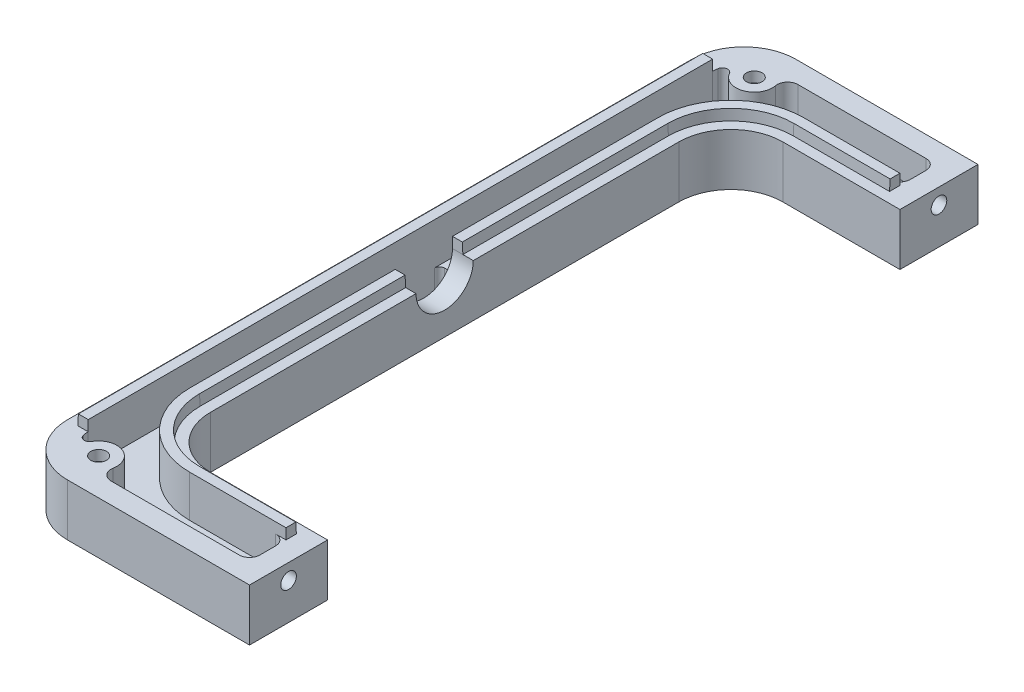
ISO-10303-21;
HEADER;
FILE_DESCRIPTION(('STEP AP214'),'2;1');
FILE_NAME('part.step','',(''),(''),'','','');
FILE_SCHEMA(('AUTOMOTIVE_DESIGN { 1 0 10303 214 1 1 1 1 }'));
ENDSEC;
DATA;
#1=APPLICATION_CONTEXT('core data for automotive mechanical design processes');
#2=APPLICATION_PROTOCOL_DEFINITION('international standard','automotive_design',2000,#1);
#3=PRODUCT_CONTEXT('',#1,'mechanical');
#4=PRODUCT('Part','Part','',(#3));
#5=PRODUCT_RELATED_PRODUCT_CATEGORY('part','',(#4));
#6=PRODUCT_DEFINITION_FORMATION('','',#4);
#7=PRODUCT_DEFINITION_CONTEXT('part definition',#1,'design');
#8=PRODUCT_DEFINITION('design','',#6,#7);
#9=PRODUCT_DEFINITION_SHAPE('','',#8);
#10=(LENGTH_UNIT() NAMED_UNIT(*) SI_UNIT(.MILLI.,.METRE.));
#11=(NAMED_UNIT(*) PLANE_ANGLE_UNIT() SI_UNIT($,.RADIAN.));
#12=(NAMED_UNIT(*) SI_UNIT($,.STERADIAN.) SOLID_ANGLE_UNIT());
#13=UNCERTAINTY_MEASURE_WITH_UNIT(LENGTH_MEASURE(1.E-05),#10,'distance_accuracy_value','');
#14=(GEOMETRIC_REPRESENTATION_CONTEXT(3) GLOBAL_UNCERTAINTY_ASSIGNED_CONTEXT((#13)) GLOBAL_UNIT_ASSIGNED_CONTEXT((#10,
#11,#12)) REPRESENTATION_CONTEXT('',''));
#15=CARTESIAN_POINT('',(0.,0.,0.));
#16=DIRECTION('',(0.,0.,1.));
#17=DIRECTION('',(1.,0.,0.));
#18=AXIS2_PLACEMENT_3D('',#15,#16,#17);
#19=CARTESIAN_POINT('',(-61.5,17.7301458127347,-59.));
#20=DIRECTION('',(1.,0.,0.));
#21=DIRECTION('',(0.,1.,0.));
#22=AXIS2_PLACEMENT_3D('',#19,#20,#21);
#23=PLANE('',#22);
#24=DIRECTION('',(0.,0.,1.));
#25=VECTOR('',#24,1.);
#26=CARTESIAN_POINT('',(-61.5,1.1,-59.));
#27=LINE('',#26,#25);
#28=CARTESIAN_POINT('',(-61.5,1.1,-64.));
#29=VERTEX_POINT('',#28);
#30=CARTESIAN_POINT('',(-61.5,1.1,-61.));
#31=VERTEX_POINT('',#30);
#32=EDGE_CURVE('E1121',#29,#31,#27,.T.);
#33=ORIENTED_EDGE('',*,*,#32,.T.);
#34=DIRECTION('',(0.,-1.,0.));
#35=VECTOR('',#34,1.);
#36=CARTESIAN_POINT('',(-61.5,17.7301458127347,-61.));
#37=LINE('',#36,#35);
#38=CARTESIAN_POINT('',(-61.5,4.1,-61.));
#39=VERTEX_POINT('',#38);
#40=EDGE_CURVE('E1354',#31,#39,#37,.F.);
#41=ORIENTED_EDGE('',*,*,#40,.T.);
#42=CARTESIAN_POINT('',(-61.5,4.1,-62.5));
#43=DIRECTION('',(-1.,0.,0.));
#44=DIRECTION('',(0.,-1.,0.));
#45=AXIS2_PLACEMENT_3D('',#42,#43,#44);
#46=CIRCLE('',#45,1.5);
#47=CARTESIAN_POINT('',(-61.5,4.1,-64.));
#48=VERTEX_POINT('',#47);
#49=EDGE_CURVE('E1049',#48,#39,#46,.T.);
#50=ORIENTED_EDGE('',*,*,#49,.F.);
#51=DIRECTION('',(0.,-1.,0.));
#52=VECTOR('',#51,1.);
#53=CARTESIAN_POINT('',(-61.5,1.1,-64.));
#54=LINE('',#53,#52);
#55=EDGE_CURVE('E1361',#48,#29,#54,.T.);
#56=ORIENTED_EDGE('',*,*,#55,.T.);
#57=EDGE_LOOP('',(#33,#41,#50,#56));
#58=FACE_BOUND('',#57,.T.);
#59=ADVANCED_FACE('F393',(#58),#23,.F.);
#60=CARTESIAN_POINT('',(-61.5,17.7301458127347,59.));
#61=DIRECTION('',(-1.,0.,0.));
#62=DIRECTION('',(0.,-1.,0.));
#63=AXIS2_PLACEMENT_3D('',#60,#61,#62);
#64=PLANE('',#63);
#65=DIRECTION('',(0.,0.,-1.));
#66=VECTOR('',#65,1.);
#67=CARTESIAN_POINT('',(-61.5,7.1,59.));
#68=LINE('',#67,#66);
#69=CARTESIAN_POINT('',(-61.5,7.1,64.));
#70=VERTEX_POINT('',#69);
#71=CARTESIAN_POINT('',(-61.5,7.1,61.));
#72=VERTEX_POINT('',#71);
#73=EDGE_CURVE('E1056',#70,#72,#68,.T.);
#74=ORIENTED_EDGE('',*,*,#73,.T.);
#75=DIRECTION('',(0.,-1.,0.));
#76=VECTOR('',#75,1.);
#77=CARTESIAN_POINT('',(-61.5,1.1,61.));
#78=LINE('',#77,#76);
#79=CARTESIAN_POINT('',(-61.5,4.1,61.));
#80=VERTEX_POINT('',#79);
#81=EDGE_CURVE('E1374',#72,#80,#78,.T.);
#82=ORIENTED_EDGE('',*,*,#81,.T.);
#83=CARTESIAN_POINT('',(-61.5,4.1,62.5));
#84=DIRECTION('',(1.,0.,0.));
#85=DIRECTION('',(0.,-1.,0.));
#86=AXIS2_PLACEMENT_3D('',#83,#84,#85);
#87=CIRCLE('',#86,1.5);
#88=CARTESIAN_POINT('',(-61.5,4.1,64.));
#89=VERTEX_POINT('',#88);
#90=EDGE_CURVE('E1028',#80,#89,#87,.T.);
#91=ORIENTED_EDGE('',*,*,#90,.T.);
#92=DIRECTION('',(0.,-1.,0.));
#93=VECTOR('',#92,1.);
#94=CARTESIAN_POINT('',(-61.5,7.1,64.));
#95=LINE('',#94,#93);
#96=EDGE_CURVE('E1381',#89,#70,#95,.F.);
#97=ORIENTED_EDGE('',*,*,#96,.T.);
#98=EDGE_LOOP('',(#74,#82,#91,#97));
#99=FACE_BOUND('',#98,.T.);
#100=ADVANCED_FACE('F1573',(#99),#64,.T.);
#101=CARTESIAN_POINT('',(-102.5,7.1,70.));
#102=DIRECTION('',(0.,1.,0.));
#103=DIRECTION('',(-1.,0.,0.));
#104=AXIS2_PLACEMENT_3D('',#101,#102,#103);
#105=PLANE('',#104);
#106=CARTESIAN_POINT('',(-93.5,7.1,-63.));
#107=DIRECTION('',(0.,1.,0.));
#108=DIRECTION('',(-1.,0.,0.));
#109=AXIS2_PLACEMENT_3D('',#106,#107,#108);
#110=CIRCLE('',#109,1.5);
#111=CARTESIAN_POINT('',(-95.,7.1,-63.));
#112=VERTEX_POINT('',#111);
#113=EDGE_CURVE('E1110',#112,#112,#110,.T.);
#114=ORIENTED_EDGE('',*,*,#113,.F.);
#115=EDGE_LOOP('',(#114));
#116=FACE_BOUND('',#115,.T.);
#117=CARTESIAN_POINT('',(-93.5,7.1,63.));
#118=DIRECTION('',(0.,1.,0.));
#119=DIRECTION('',(-1.,0.,0.));
#120=AXIS2_PLACEMENT_3D('',#117,#118,#119);
#121=CIRCLE('',#120,1.5);
#122=CARTESIAN_POINT('',(-95.,7.1,63.));
#123=VERTEX_POINT('',#122);
#124=EDGE_CURVE('E1486',#123,#123,#121,.F.);
#125=ORIENTED_EDGE('',*,*,#124,.T.);
#126=EDGE_LOOP('',(#125));
#127=FACE_BOUND('',#126,.T.);
#128=DIRECTION('',(0.,0.,1.));
#129=VECTOR('',#128,1.);
#130=CARTESIAN_POINT('',(-100.5,7.1,70.));
#131=LINE('',#130,#129);
#132=CARTESIAN_POINT('',(-100.5,7.1,-60.));
#133=VERTEX_POINT('',#132);
#134=CARTESIAN_POINT('',(-100.5,7.1,60.));
#135=VERTEX_POINT('',#134);
#136=EDGE_CURVE('E898',#133,#135,#131,.T.);
#137=ORIENTED_EDGE('',*,*,#136,.F.);
#138=DIRECTION('',(-1.,0.,0.));
#139=VECTOR('',#138,1.);
#140=CARTESIAN_POINT('',(-102.5,7.1,-60.));
#141=LINE('',#140,#139);
#142=CARTESIAN_POINT('',(-98.5,7.1,-60.));
#143=VERTEX_POINT('',#142);
#144=EDGE_CURVE('E891',#143,#133,#141,.T.);
#145=ORIENTED_EDGE('',*,*,#144,.F.);
#146=CARTESIAN_POINT('',(-92.5,7.1,-60.));
#147=DIRECTION('',(0.,1.,0.));
#148=DIRECTION('',(-1.,0.,0.));
#149=AXIS2_PLACEMENT_3D('',#146,#147,#148);
#150=CIRCLE('',#149,6.);
#151=CARTESIAN_POINT('',(-98.4199751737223,7.1,-60.9766749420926));
#152=VERTEX_POINT('',#151);
#153=EDGE_CURVE('E1156',#152,#143,#150,.T.);
#154=ORIENTED_EDGE('',*,*,#153,.F.);
#155=CARTESIAN_POINT('',(-97.4333126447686,7.1,-60.8138957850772));
#156=DIRECTION('',(0.,1.,0.));
#157=DIRECTION('',(-1.,0.,0.));
#158=AXIS2_PLACEMENT_3D('',#155,#156,#157);
#159=CIRCLE('',#158,1.);
#160=CARTESIAN_POINT('',(-96.5592431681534,7.1,-61.2996967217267));
#161=VERTEX_POINT('',#160);
#162=EDGE_CURVE('E401',#152,#161,#159,.F.);
#163=ORIENTED_EDGE('',*,*,#162,.T.);
#164=CARTESIAN_POINT('',(-93.5,7.1,-63.));
#165=DIRECTION('',(0.,1.,0.));
#166=DIRECTION('',(-1.,0.,0.));
#167=AXIS2_PLACEMENT_3D('',#164,#165,#166);
#168=CIRCLE('',#167,3.50000000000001);
#169=CARTESIAN_POINT('',(-90.0583374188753,7.1,-63.6363636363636));
#170=VERTEX_POINT('',#169);
#171=EDGE_CURVE('E1118',#170,#161,#168,.F.);
#172=ORIENTED_EDGE('',*,*,#171,.F.);
#173=CARTESIAN_POINT('',(-88.091673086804,7.1,-64.));
#174=DIRECTION('',(0.,1.,0.));
#175=DIRECTION('',(-1.,0.,0.));
#176=AXIS2_PLACEMENT_3D('',#173,#174,#175);
#177=CIRCLE('',#176,2.);
#178=CARTESIAN_POINT('',(-88.091673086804,7.1,-66.));
#179=VERTEX_POINT('',#178);
#180=EDGE_CURVE('E1352',#170,#179,#177,.F.);
#181=ORIENTED_EDGE('',*,*,#180,.T.);
#182=DIRECTION('',(1.,0.,0.));
#183=VECTOR('',#182,1.);
#184=CARTESIAN_POINT('',(0.,7.1,-66.));
#185=LINE('',#184,#183);
#186=CARTESIAN_POINT('',(-63.5,7.1,-66.));
#187=VERTEX_POINT('',#186);
#188=EDGE_CURVE('E1164',#179,#187,#185,.T.);
#189=ORIENTED_EDGE('',*,*,#188,.T.);
#190=CARTESIAN_POINT('',(-63.5,7.1,-64.));
#191=DIRECTION('',(0.,1.,0.));
#192=DIRECTION('',(-1.,0.,0.));
#193=AXIS2_PLACEMENT_3D('',#190,#191,#192);
#194=CIRCLE('',#193,2.);
#195=CARTESIAN_POINT('',(-61.5,7.1,-64.));
#196=VERTEX_POINT('',#195);
#197=EDGE_CURVE('E1342',#187,#196,#194,.F.);
#198=ORIENTED_EDGE('',*,*,#197,.T.);
#199=DIRECTION('',(0.,0.,1.));
#200=VECTOR('',#199,1.);
#201=CARTESIAN_POINT('',(-61.5,7.1,-59.));
#202=LINE('',#201,#200);
#203=CARTESIAN_POINT('',(-61.5,7.1,-61.));
#204=VERTEX_POINT('',#203);
#205=EDGE_CURVE('E1124',#196,#204,#202,.T.);
#206=ORIENTED_EDGE('',*,*,#205,.T.);
#207=CARTESIAN_POINT('',(-63.5,7.1,-61.));
#208=DIRECTION('',(0.,1.,0.));
#209=DIRECTION('',(-1.,0.,0.));
#210=AXIS2_PLACEMENT_3D('',#207,#208,#209);
#211=CIRCLE('',#210,2.);
#212=CARTESIAN_POINT('',(-63.5,7.1,-59.));
#213=VERTEX_POINT('',#212);
#214=EDGE_CURVE('E1344',#204,#213,#211,.F.);
#215=ORIENTED_EDGE('',*,*,#214,.T.);
#216=DIRECTION('',(-1.,0.,0.));
#217=VECTOR('',#216,1.);
#218=CARTESIAN_POINT('',(-102.5,7.1,-59.));
#219=LINE('',#218,#217);
#220=CARTESIAN_POINT('',(-61.5,7.1,-59.));
#221=VERTEX_POINT('',#220);
#222=EDGE_CURVE('E1366',#221,#213,#219,.T.);
#223=ORIENTED_EDGE('',*,*,#222,.F.);
#224=DIRECTION('',(0.,0.,1.));
#225=VECTOR('',#224,1.);
#226=CARTESIAN_POINT('',(-61.5,7.1,70.));
#227=LINE('',#226,#225);
#228=CARTESIAN_POINT('',(-61.5,7.1,-57.));
#229=VERTEX_POINT('',#228);
#230=EDGE_CURVE('E965',#229,#221,#227,.F.);
#231=ORIENTED_EDGE('',*,*,#230,.F.);
#232=DIRECTION('',(1.,0.,0.));
#233=VECTOR('',#232,1.);
#234=CARTESIAN_POINT('',(-102.5,7.1,-57.));
#235=LINE('',#234,#233);
#236=CARTESIAN_POINT('',(-80.,7.1,-57.));
#237=VERTEX_POINT('',#236);
#238=EDGE_CURVE('E976',#237,#229,#235,.T.);
#239=ORIENTED_EDGE('',*,*,#238,.F.);
#240=CARTESIAN_POINT('',(-80.,7.1,-45.));
#241=DIRECTION('',(0.,1.,0.));
#242=DIRECTION('',(-1.,0.,0.));
#243=AXIS2_PLACEMENT_3D('',#240,#241,#242);
#244=CIRCLE('',#243,12.);
#245=CARTESIAN_POINT('',(-92.,7.1,-45.));
#246=VERTEX_POINT('',#245);
#247=EDGE_CURVE('E979',#237,#246,#244,.T.);
#248=ORIENTED_EDGE('',*,*,#247,.T.);
#249=DIRECTION('',(0.,0.,-1.));
#250=VECTOR('',#249,1.);
#251=CARTESIAN_POINT('',(-92.,7.1,70.));
#252=LINE('',#251,#250);
#253=CARTESIAN_POINT('',(-92.,7.1,-5.5));
#254=VERTEX_POINT('',#253);
#255=EDGE_CURVE('E981',#254,#246,#252,.T.);
#256=ORIENTED_EDGE('',*,*,#255,.F.);
#257=DIRECTION('',(-1.,0.,0.));
#258=VECTOR('',#257,1.);
#259=CARTESIAN_POINT('',(-45.443650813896,7.1,-5.50000000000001));
#260=LINE('',#259,#258);
#261=CARTESIAN_POINT('',(-90.,7.1,-5.5));
#262=VERTEX_POINT('',#261);
#263=EDGE_CURVE('E1136',#262,#254,#260,.T.);
#264=ORIENTED_EDGE('',*,*,#263,.F.);
#265=DIRECTION('',(0.,0.,1.));
#266=VECTOR('',#265,1.);
#267=CARTESIAN_POINT('',(-90.,7.1,-55.));
#268=LINE('',#267,#266);
#269=CARTESIAN_POINT('',(-90.,7.1,-45.));
#270=VERTEX_POINT('',#269);
#271=EDGE_CURVE('E1099',#270,#262,#268,.T.);
#272=ORIENTED_EDGE('',*,*,#271,.F.);
#273=CARTESIAN_POINT('',(-80.,7.1,-45.));
#274=DIRECTION('',(0.,1.,0.));
#275=DIRECTION('',(-1.,0.,0.));
#276=AXIS2_PLACEMENT_3D('',#273,#274,#275);
#277=CIRCLE('',#276,10.);
#278=CARTESIAN_POINT('',(-80.,7.1,-55.));
#279=VERTEX_POINT('',#278);
#280=EDGE_CURVE('E1477',#270,#279,#277,.F.);
#281=ORIENTED_EDGE('',*,*,#280,.T.);
#282=DIRECTION('',(-1.,0.,0.));
#283=VECTOR('',#282,1.);
#284=CARTESIAN_POINT('',(-65.,7.1,-55.));
#285=LINE('',#284,#283);
#286=CARTESIAN_POINT('',(-57.5,7.1,-55.));
#287=VERTEX_POINT('',#286);
#288=EDGE_CURVE('E1095',#287,#279,#285,.T.);
#289=ORIENTED_EDGE('',*,*,#288,.F.);
#290=DIRECTION('',(0.,0.,1.));
#291=VECTOR('',#290,1.);
#292=CARTESIAN_POINT('',(-57.5,7.1,70.));
#293=LINE('',#292,#291);
#294=CARTESIAN_POINT('',(-57.5,7.1,-70.));
#295=VERTEX_POINT('',#294);
#296=EDGE_CURVE('E1410',#295,#287,#293,.T.);
#297=ORIENTED_EDGE('',*,*,#296,.F.);
#298=DIRECTION('',(1.,0.,0.));
#299=VECTOR('',#298,1.);
#300=CARTESIAN_POINT('',(-102.5,7.1,-70.));
#301=LINE('',#300,#299);
#302=CARTESIAN_POINT('',(-92.5,7.1,-70.));
#303=VERTEX_POINT('',#302);
#304=EDGE_CURVE('E1426',#303,#295,#301,.T.);
#305=ORIENTED_EDGE('',*,*,#304,.F.);
#306=CARTESIAN_POINT('',(-92.5,7.1,-60.));
#307=DIRECTION('',(0.,1.,0.));
#308=DIRECTION('',(-1.,0.,0.));
#309=AXIS2_PLACEMENT_3D('',#306,#307,#308);
#310=CIRCLE('',#309,10.);
#311=CARTESIAN_POINT('',(-102.5,7.1,-60.));
#312=VERTEX_POINT('',#311);
#313=EDGE_CURVE('E1452',#303,#312,#310,.T.);
#314=ORIENTED_EDGE('',*,*,#313,.T.);
#315=DIRECTION('',(0.,0.,-1.));
#316=VECTOR('',#315,1.);
#317=CARTESIAN_POINT('',(-102.5,7.1,70.));
#318=LINE('',#317,#316);
#319=CARTESIAN_POINT('',(-102.5,7.1,60.));
#320=VERTEX_POINT('',#319);
#321=EDGE_CURVE('E1438',#320,#312,#318,.T.);
#322=ORIENTED_EDGE('',*,*,#321,.F.);
#323=CARTESIAN_POINT('',(-92.5,7.1,60.));
#324=DIRECTION('',(0.,1.,0.));
#325=DIRECTION('',(-1.,0.,0.));
#326=AXIS2_PLACEMENT_3D('',#323,#324,#325);
#327=CIRCLE('',#326,10.);
#328=CARTESIAN_POINT('',(-92.5,7.1,70.));
#329=VERTEX_POINT('',#328);
#330=EDGE_CURVE('E1448',#320,#329,#327,.T.);
#331=ORIENTED_EDGE('',*,*,#330,.T.);
#332=DIRECTION('',(1.,0.,0.));
#333=VECTOR('',#332,1.);
#334=CARTESIAN_POINT('',(-102.5,7.1,70.));
#335=LINE('',#334,#333);
#336=CARTESIAN_POINT('',(-57.5,7.1,70.));
#337=VERTEX_POINT('',#336);
#338=EDGE_CURVE('E1437',#329,#337,#335,.T.);
#339=ORIENTED_EDGE('',*,*,#338,.T.);
#340=DIRECTION('',(0.,0.,1.));
#341=VECTOR('',#340,1.);
#342=CARTESIAN_POINT('',(-57.5,7.1,70.));
#343=LINE('',#342,#341);
#344=CARTESIAN_POINT('',(-57.5,7.1,55.));
#345=VERTEX_POINT('',#344);
#346=EDGE_CURVE('E1415',#345,#337,#343,.T.);
#347=ORIENTED_EDGE('',*,*,#346,.F.);
#348=DIRECTION('',(1.,0.,0.));
#349=VECTOR('',#348,1.);
#350=CARTESIAN_POINT('',(-90.,7.1,55.));
#351=LINE('',#350,#349);
#352=CARTESIAN_POINT('',(-80.,7.1,55.));
#353=VERTEX_POINT('',#352);
#354=EDGE_CURVE('E1517',#353,#345,#351,.T.);
#355=ORIENTED_EDGE('',*,*,#354,.F.);
#356=CARTESIAN_POINT('',(-80.,7.1,45.));
#357=DIRECTION('',(0.,1.,0.));
#358=DIRECTION('',(-1.,0.,0.));
#359=AXIS2_PLACEMENT_3D('',#356,#357,#358);
#360=CIRCLE('',#359,10.);
#361=CARTESIAN_POINT('',(-90.,7.1,45.));
#362=VERTEX_POINT('',#361);
#363=EDGE_CURVE('E1472',#353,#362,#360,.F.);
#364=ORIENTED_EDGE('',*,*,#363,.T.);
#365=CARTESIAN_POINT('',(-90.,7.1,5.5));
#366=VERTEX_POINT('',#365);
#367=EDGE_CURVE('E1098',#366,#362,#268,.T.);
#368=ORIENTED_EDGE('',*,*,#367,.F.);
#369=DIRECTION('',(-1.,0.,0.));
#370=VECTOR('',#369,1.);
#371=CARTESIAN_POINT('',(-45.443650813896,7.1,5.49999999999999));
#372=LINE('',#371,#370);
#373=CARTESIAN_POINT('',(-92.,7.1,5.5));
#374=VERTEX_POINT('',#373);
#375=EDGE_CURVE('E1634',#374,#366,#372,.F.);
#376=ORIENTED_EDGE('',*,*,#375,.F.);
#377=DIRECTION('',(0.,0.,-1.));
#378=VECTOR('',#377,1.);
#379=CARTESIAN_POINT('',(-92.,7.1,70.));
#380=LINE('',#379,#378);
#381=CARTESIAN_POINT('',(-92.,7.1,45.));
#382=VERTEX_POINT('',#381);
#383=EDGE_CURVE('E902',#382,#374,#380,.T.);
#384=ORIENTED_EDGE('',*,*,#383,.F.);
#385=CARTESIAN_POINT('',(-80.,7.1,45.));
#386=DIRECTION('',(0.,1.,0.));
#387=DIRECTION('',(-1.,0.,0.));
#388=AXIS2_PLACEMENT_3D('',#385,#386,#387);
#389=CIRCLE('',#388,12.);
#390=CARTESIAN_POINT('',(-80.,7.1,57.));
#391=VERTEX_POINT('',#390);
#392=EDGE_CURVE('E928',#382,#391,#389,.T.);
#393=ORIENTED_EDGE('',*,*,#392,.T.);
#394=DIRECTION('',(-1.,0.,0.));
#395=VECTOR('',#394,1.);
#396=CARTESIAN_POINT('',(-102.5,7.1,57.));
#397=LINE('',#396,#395);
#398=CARTESIAN_POINT('',(-61.5,7.1,57.));
#399=VERTEX_POINT('',#398);
#400=EDGE_CURVE('E930',#399,#391,#397,.T.);
#401=ORIENTED_EDGE('',*,*,#400,.F.);
#402=DIRECTION('',(0.,0.,-1.));
#403=VECTOR('',#402,1.);
#404=CARTESIAN_POINT('',(-61.5,7.1,70.));
#405=LINE('',#404,#403);
#406=CARTESIAN_POINT('',(-61.5,7.1,59.));
#407=VERTEX_POINT('',#406);
#408=EDGE_CURVE('E912',#407,#399,#405,.T.);
#409=ORIENTED_EDGE('',*,*,#408,.F.);
#410=DIRECTION('',(1.,0.,0.));
#411=VECTOR('',#410,1.);
#412=CARTESIAN_POINT('',(-102.5,7.1,59.));
#413=LINE('',#412,#411);
#414=CARTESIAN_POINT('',(-63.5,7.1,59.));
#415=VERTEX_POINT('',#414);
#416=EDGE_CURVE('E1372',#415,#407,#413,.T.);
#417=ORIENTED_EDGE('',*,*,#416,.F.);
#418=CARTESIAN_POINT('',(-63.5,7.1,61.));
#419=DIRECTION('',(0.,1.,0.));
#420=DIRECTION('',(-1.,0.,0.));
#421=AXIS2_PLACEMENT_3D('',#418,#419,#420);
#422=CIRCLE('',#421,2.);
#423=EDGE_CURVE('E1348',#415,#72,#422,.F.);
#424=ORIENTED_EDGE('',*,*,#423,.T.);
#425=ORIENTED_EDGE('',*,*,#73,.F.);
#426=CARTESIAN_POINT('',(-63.5,7.1,64.));
#427=DIRECTION('',(0.,1.,0.));
#428=DIRECTION('',(-1.,0.,0.));
#429=AXIS2_PLACEMENT_3D('',#426,#427,#428);
#430=CIRCLE('',#429,2.);
#431=CARTESIAN_POINT('',(-63.5,7.1,66.));
#432=VERTEX_POINT('',#431);
#433=EDGE_CURVE('E1346',#70,#432,#430,.F.);
#434=ORIENTED_EDGE('',*,*,#433,.T.);
#435=DIRECTION('',(1.,0.,0.));
#436=VECTOR('',#435,1.);
#437=CARTESIAN_POINT('',(0.,7.1,66.));
#438=LINE('',#437,#436);
#439=CARTESIAN_POINT('',(-88.091673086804,7.1,66.));
#440=VERTEX_POINT('',#439);
#441=EDGE_CURVE('E1072',#440,#432,#438,.T.);
#442=ORIENTED_EDGE('',*,*,#441,.F.);
#443=CARTESIAN_POINT('',(-88.091673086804,7.1,64.));
#444=DIRECTION('',(0.,1.,0.));
#445=DIRECTION('',(-1.,0.,0.));
#446=AXIS2_PLACEMENT_3D('',#443,#444,#445);
#447=CIRCLE('',#446,2.);
#448=CARTESIAN_POINT('',(-90.0583374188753,7.1,63.6363636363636));
#449=VERTEX_POINT('',#448);
#450=EDGE_CURVE('E1350',#440,#449,#447,.F.);
#451=ORIENTED_EDGE('',*,*,#450,.T.);
#452=CARTESIAN_POINT('',(-93.5,7.1,63.));
#453=DIRECTION('',(0.,1.,0.));
#454=DIRECTION('',(-1.,0.,0.));
#455=AXIS2_PLACEMENT_3D('',#452,#453,#454);
#456=CIRCLE('',#455,3.50000000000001);
#457=CARTESIAN_POINT('',(-96.5592431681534,7.1,61.2996967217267));
#458=VERTEX_POINT('',#457);
#459=EDGE_CURVE('E1653',#449,#458,#456,.T.);
#460=ORIENTED_EDGE('',*,*,#459,.T.);
#461=CARTESIAN_POINT('',(-97.4333126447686,7.1,60.8138957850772));
#462=DIRECTION('',(0.,1.,0.));
#463=DIRECTION('',(-1.,0.,0.));
#464=AXIS2_PLACEMENT_3D('',#461,#462,#463);
#465=CIRCLE('',#464,1.);
#466=CARTESIAN_POINT('',(-98.4199751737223,7.1,60.9766749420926));
#467=VERTEX_POINT('',#466);
#468=EDGE_CURVE('E14',#458,#467,#465,.F.);
#469=ORIENTED_EDGE('',*,*,#468,.T.);
#470=CARTESIAN_POINT('',(-92.5,7.1,60.));
#471=DIRECTION('',(0.,1.,0.));
#472=DIRECTION('',(-1.,0.,0.));
#473=AXIS2_PLACEMENT_3D('',#470,#471,#472);
#474=CIRCLE('',#473,6.);
#475=CARTESIAN_POINT('',(-98.5,7.1,60.));
#476=VERTEX_POINT('',#475);
#477=EDGE_CURVE('E1079',#476,#467,#474,.T.);
#478=ORIENTED_EDGE('',*,*,#477,.F.);
#479=DIRECTION('',(-1.,0.,0.));
#480=VECTOR('',#479,1.);
#481=CARTESIAN_POINT('',(-102.5,7.1,60.));
#482=LINE('',#481,#480);
#483=EDGE_CURVE('E882',#135,#476,#482,.F.);
#484=ORIENTED_EDGE('',*,*,#483,.F.);
#485=EDGE_LOOP('',(#137,#145,#154,#163,#172,#181,#189,#198,#206,#215,#223,#231,#239,#248,#256,
#264,#272,#281,#289,#297,#305,#314,#322,#331,#339,#347,#355,#364,#368,#376,#384,#393,#401,#409,
#417,#424,#425,#434,#442,#451,#460,#469,#478,#484));
#486=FACE_BOUND('',#485,.T.);
#487=ADVANCED_FACE('F1258',(#116,#127,#486),#105,.T.);
#488=CARTESIAN_POINT('',(-57.5,-19.91,-70.));
#489=DIRECTION('',(-1.,0.,0.));
#490=DIRECTION('',(0.,0.,1.));
#491=AXIS2_PLACEMENT_3D('',#488,#489,#490);
#492=PLANE('',#491);
#493=DIRECTION('',(0.,0.,-1.));
#494=VECTOR('',#493,1.);
#495=CARTESIAN_POINT('',(-57.5,-2.89999999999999,70.));
#496=LINE('',#495,#494);
#497=CARTESIAN_POINT('',(-57.5,-2.89999999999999,-55.));
#498=VERTEX_POINT('',#497);
#499=CARTESIAN_POINT('',(-57.5,-2.89999999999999,-70.));
#500=VERTEX_POINT('',#499);
#501=EDGE_CURVE('E1089',#498,#500,#496,.T.);
#502=ORIENTED_EDGE('',*,*,#501,.T.);
#503=DIRECTION('',(0.,1.,0.));
#504=VECTOR('',#503,1.);
#505=CARTESIAN_POINT('',(-57.5,0.,-70.));
#506=LINE('',#505,#504);
#507=EDGE_CURVE('E1493',#500,#295,#506,.T.);
#508=ORIENTED_EDGE('',*,*,#507,.T.);
#509=ORIENTED_EDGE('',*,*,#296,.T.);
#510=DIRECTION('',(0.,-1.,0.));
#511=VECTOR('',#510,1.);
#512=CARTESIAN_POINT('',(-57.5,7.10100000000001,-55.));
#513=LINE('',#512,#511);
#514=EDGE_CURVE('E1086',#287,#498,#513,.T.);
#515=ORIENTED_EDGE('',*,*,#514,.T.);
#516=EDGE_LOOP('',(#502,#508,#509,#515));
#517=FACE_BOUND('',#516,.T.);
#518=CARTESIAN_POINT('',(-57.5,4.1,-62.5));
#519=DIRECTION('',(-1.,0.,0.));
#520=DIRECTION('',(0.,0.,1.));
#521=AXIS2_PLACEMENT_3D('',#518,#519,#520);
#522=CIRCLE('',#521,1.5);
#523=CARTESIAN_POINT('',(-57.5,4.1,-61.));
#524=VERTEX_POINT('',#523);
#525=EDGE_CURVE('E1411',#524,#524,#522,.F.);
#526=ORIENTED_EDGE('',*,*,#525,.F.);
#527=EDGE_LOOP('',(#526));
#528=FACE_BOUND('',#527,.T.);
#529=ADVANCED_FACE('F1754',(#517,#528),#492,.F.);
#530=CARTESIAN_POINT('',(-57.5,-19.91,55.));
#531=DIRECTION('',(-1.,0.,0.));
#532=DIRECTION('',(0.,0.,1.));
#533=AXIS2_PLACEMENT_3D('',#530,#531,#532);
#534=PLANE('',#533);
#535=CARTESIAN_POINT('',(-57.5,-2.89999999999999,70.));
#536=VERTEX_POINT('',#535);
#537=CARTESIAN_POINT('',(-57.5,-2.89999999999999,55.));
#538=VERTEX_POINT('',#537);
#539=EDGE_CURVE('E1492',#536,#538,#496,.T.);
#540=ORIENTED_EDGE('',*,*,#539,.T.);
#541=DIRECTION('',(0.,-1.,0.));
#542=VECTOR('',#541,1.);
#543=CARTESIAN_POINT('',(-57.5,7.10100000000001,55.));
#544=LINE('',#543,#542);
#545=EDGE_CURVE('E1082',#345,#538,#544,.T.);
#546=ORIENTED_EDGE('',*,*,#545,.F.);
#547=ORIENTED_EDGE('',*,*,#346,.T.);
#548=DIRECTION('',(0.,1.,0.));
#549=VECTOR('',#548,1.);
#550=CARTESIAN_POINT('',(-57.5,0.,70.));
#551=LINE('',#550,#549);
#552=EDGE_CURVE('E1408',#536,#337,#551,.T.);
#553=ORIENTED_EDGE('',*,*,#552,.F.);
#554=EDGE_LOOP('',(#540,#546,#547,#553));
#555=FACE_BOUND('',#554,.T.);
#556=CARTESIAN_POINT('',(-57.5,4.1,62.5));
#557=DIRECTION('',(-1.,0.,0.));
#558=DIRECTION('',(0.,0.,1.));
#559=AXIS2_PLACEMENT_3D('',#556,#557,#558);
#560=CIRCLE('',#559,1.5);
#561=CARTESIAN_POINT('',(-57.5,4.1,64.));
#562=VERTEX_POINT('',#561);
#563=EDGE_CURVE('E1489',#562,#562,#560,.T.);
#564=ORIENTED_EDGE('',*,*,#563,.T.);
#565=EDGE_LOOP('',(#564));
#566=FACE_BOUND('',#565,.T.);
#567=ADVANCED_FACE('F1503',(#555,#566),#534,.F.);
#568=CARTESIAN_POINT('',(-93.5,5.1,63.));
#569=DIRECTION('',(0.,-1.,0.));
#570=DIRECTION('',(1.,0.,0.));
#571=AXIS2_PLACEMENT_3D('',#568,#569,#570);
#572=PLANE('',#571);
#573=CARTESIAN_POINT('',(-93.5,5.1,63.));
#574=DIRECTION('',(0.,-1.,0.));
#575=DIRECTION('',(1.,0.,0.));
#576=AXIS2_PLACEMENT_3D('',#573,#574,#575);
#577=CIRCLE('',#576,2.5);
#578=CARTESIAN_POINT('',(-91.,5.1,63.));
#579=VERTEX_POINT('',#578);
#580=EDGE_CURVE('E1129',#579,#579,#577,.T.);
#581=ORIENTED_EDGE('',*,*,#580,.T.);
#582=EDGE_LOOP('',(#581));
#583=FACE_BOUND('',#582,.T.);
#584=CARTESIAN_POINT('',(-93.5,5.1,63.));
#585=DIRECTION('',(0.,-1.,0.));
#586=DIRECTION('',(1.,0.,0.));
#587=AXIS2_PLACEMENT_3D('',#584,#585,#586);
#588=CIRCLE('',#587,1.5);
#589=CARTESIAN_POINT('',(-92.,5.1,63.));
#590=VERTEX_POINT('',#589);
#591=EDGE_CURVE('E1483',#590,#590,#588,.F.);
#592=ORIENTED_EDGE('',*,*,#591,.T.);
#593=EDGE_LOOP('',(#592));
#594=FACE_BOUND('',#593,.T.);
#595=ADVANCED_FACE('F1666',(#583,#594),#572,.T.);
#596=CARTESIAN_POINT('',(-93.5,5.1,-63.));
#597=DIRECTION('',(0.,-1.,0.));
#598=DIRECTION('',(1.,0.,0.));
#599=AXIS2_PLACEMENT_3D('',#596,#597,#598);
#600=PLANE('',#599);
#601=CARTESIAN_POINT('',(-93.5,5.1,-63.));
#602=DIRECTION('',(0.,-1.,0.));
#603=DIRECTION('',(1.,0.,0.));
#604=AXIS2_PLACEMENT_3D('',#601,#602,#603);
#605=CIRCLE('',#604,1.5);
#606=CARTESIAN_POINT('',(-92.,5.1,-63.));
#607=VERTEX_POINT('',#606);
#608=EDGE_CURVE('E1115',#607,#607,#605,.T.);
#609=ORIENTED_EDGE('',*,*,#608,.F.);
#610=EDGE_LOOP('',(#609));
#611=FACE_BOUND('',#610,.T.);
#612=CARTESIAN_POINT('',(-93.5,5.1,-63.));
#613=DIRECTION('',(0.,1.,0.));
#614=DIRECTION('',(1.,0.,0.));
#615=AXIS2_PLACEMENT_3D('',#612,#613,#614);
#616=CIRCLE('',#615,2.5);
#617=CARTESIAN_POINT('',(-91.,5.1,-63.));
#618=VERTEX_POINT('',#617);
#619=EDGE_CURVE('E1061',#618,#618,#616,.T.);
#620=ORIENTED_EDGE('',*,*,#619,.F.);
#621=EDGE_LOOP('',(#620));
#622=FACE_BOUND('',#621,.T.);
#623=ADVANCED_FACE('F2066',(#611,#622),#600,.T.);
#624=CARTESIAN_POINT('',(-57.5,1.10000000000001,70.));
#625=DIRECTION('',(0.,-1.,0.));
#626=DIRECTION('',(1.,0.,0.));
#627=AXIS2_PLACEMENT_3D('',#624,#625,#626);
#628=PLANE('',#627);
#629=DIRECTION('',(0.,0.,1.));
#630=VECTOR('',#629,1.);
#631=CARTESIAN_POINT('',(-94.,1.1,-55.));
#632=LINE('',#631,#630);
#633=CARTESIAN_POINT('',(-94.,1.1,-10.25));
#634=VERTEX_POINT('',#633);
#635=CARTESIAN_POINT('',(-94.,1.1,-6.5));
#636=VERTEX_POINT('',#635);
#637=EDGE_CURVE('E1171',#634,#636,#632,.T.);
#638=ORIENTED_EDGE('',*,*,#637,.F.);
#639=CARTESIAN_POINT('',(-95.,1.1,-10.25));
#640=DIRECTION('',(0.,-1.,0.));
#641=DIRECTION('',(1.,0.,0.));
#642=AXIS2_PLACEMENT_3D('',#639,#640,#641);
#643=CIRCLE('',#642,1.);
#644=CARTESIAN_POINT('',(-95.,1.1,-9.25000000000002));
#645=VERTEX_POINT('',#644);
#646=EDGE_CURVE('E1242',#634,#645,#643,.T.);
#647=ORIENTED_EDGE('',*,*,#646,.T.);
#648=DIRECTION('',(1.,0.,0.));
#649=VECTOR('',#648,1.);
#650=CARTESIAN_POINT('',(-98.5,1.1,-9.25000000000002));
#651=LINE('',#650,#649);
#652=CARTESIAN_POINT('',(-97.5,1.1,-9.25000000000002));
#653=VERTEX_POINT('',#652);
#654=EDGE_CURVE('E1031',#653,#645,#651,.T.);
#655=ORIENTED_EDGE('',*,*,#654,.F.);
#656=CARTESIAN_POINT('',(-97.5,1.1,-10.25));
#657=DIRECTION('',(0.,-1.,0.));
#658=DIRECTION('',(1.,0.,0.));
#659=AXIS2_PLACEMENT_3D('',#656,#657,#658);
#660=CIRCLE('',#659,1.);
#661=CARTESIAN_POINT('',(-98.5,1.1,-10.25));
#662=VERTEX_POINT('',#661);
#663=EDGE_CURVE('E1246',#653,#662,#660,.T.);
#664=ORIENTED_EDGE('',*,*,#663,.T.);
#665=DIRECTION('',(0.,0.,-1.));
#666=VECTOR('',#665,1.);
#667=CARTESIAN_POINT('',(-98.5,1.1,70.));
#668=LINE('',#667,#666);
#669=CARTESIAN_POINT('',(-98.5,1.1,-6.50000000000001));
#670=VERTEX_POINT('',#669);
#671=EDGE_CURVE('E1158',#670,#662,#668,.T.);
#672=ORIENTED_EDGE('',*,*,#671,.F.);
#673=CARTESIAN_POINT('',(-97.5,1.1,-6.5));
#674=DIRECTION('',(0.,-1.,0.));
#675=DIRECTION('',(1.,0.,0.));
#676=AXIS2_PLACEMENT_3D('',#673,#674,#675);
#677=CIRCLE('',#676,1.);
#678=CARTESIAN_POINT('',(-97.5,1.1,-7.5));
#679=VERTEX_POINT('',#678);
#680=EDGE_CURVE('E1224',#670,#679,#677,.T.);
#681=ORIENTED_EDGE('',*,*,#680,.T.);
#682=DIRECTION('',(-1.,0.,0.));
#683=VECTOR('',#682,1.);
#684=CARTESIAN_POINT('',(-98.5,1.1,-7.5));
#685=LINE('',#684,#683);
#686=CARTESIAN_POINT('',(-95.,1.1,-7.5));
#687=VERTEX_POINT('',#686);
#688=EDGE_CURVE('E1651',#687,#679,#685,.T.);
#689=ORIENTED_EDGE('',*,*,#688,.F.);
#690=CARTESIAN_POINT('',(-95.,1.1,-6.5));
#691=DIRECTION('',(0.,-1.,0.));
#692=DIRECTION('',(1.,0.,0.));
#693=AXIS2_PLACEMENT_3D('',#690,#691,#692);
#694=CIRCLE('',#693,1.);
#695=EDGE_CURVE('E1228',#687,#636,#694,.T.);
#696=ORIENTED_EDGE('',*,*,#695,.T.);
#697=EDGE_LOOP('',(#638,#647,#655,#664,#672,#681,#689,#696));
#698=FACE_BOUND('',#697,.T.);
#699=ADVANCED_FACE('F2050',(#698),#628,.F.);
#700=CARTESIAN_POINT('',(-98.5,1.1,10.25));
#701=VERTEX_POINT('',#700);
#702=CARTESIAN_POINT('',(-98.5,1.1,6.50000000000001));
#703=VERTEX_POINT('',#702);
#704=EDGE_CURVE('E1157',#701,#703,#668,.T.);
#705=ORIENTED_EDGE('',*,*,#704,.F.);
#706=CARTESIAN_POINT('',(-97.5,1.1,10.25));
#707=DIRECTION('',(0.,-1.,0.));
#708=DIRECTION('',(1.,0.,0.));
#709=AXIS2_PLACEMENT_3D('',#706,#707,#708);
#710=CIRCLE('',#709,1.);
#711=CARTESIAN_POINT('',(-97.5,1.1,9.25000000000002));
#712=VERTEX_POINT('',#711);
#713=EDGE_CURVE('E1256',#701,#712,#710,.T.);
#714=ORIENTED_EDGE('',*,*,#713,.T.);
#715=DIRECTION('',(1.,0.,0.));
#716=VECTOR('',#715,1.);
#717=CARTESIAN_POINT('',(-98.5,1.1,9.25000000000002));
#718=LINE('',#717,#716);
#719=CARTESIAN_POINT('',(-95.,1.1,9.25000000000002));
#720=VERTEX_POINT('',#719);
#721=EDGE_CURVE('E1024',#712,#720,#718,.T.);
#722=ORIENTED_EDGE('',*,*,#721,.T.);
#723=CARTESIAN_POINT('',(-95.,1.1,10.25));
#724=DIRECTION('',(0.,-1.,0.));
#725=DIRECTION('',(1.,0.,0.));
#726=AXIS2_PLACEMENT_3D('',#723,#724,#725);
#727=CIRCLE('',#726,1.);
#728=CARTESIAN_POINT('',(-94.,1.1,10.25));
#729=VERTEX_POINT('',#728);
#730=EDGE_CURVE('E1206',#720,#729,#727,.T.);
#731=ORIENTED_EDGE('',*,*,#730,.T.);
#732=CARTESIAN_POINT('',(-94.,1.1,6.5));
#733=VERTEX_POINT('',#732);
#734=EDGE_CURVE('E1172',#733,#729,#632,.T.);
#735=ORIENTED_EDGE('',*,*,#734,.F.);
#736=CARTESIAN_POINT('',(-95.,1.1,6.5));
#737=DIRECTION('',(0.,-1.,0.));
#738=DIRECTION('',(1.,0.,0.));
#739=AXIS2_PLACEMENT_3D('',#736,#737,#738);
#740=CIRCLE('',#739,1.);
#741=CARTESIAN_POINT('',(-95.,1.1,7.5));
#742=VERTEX_POINT('',#741);
#743=EDGE_CURVE('E1215',#733,#742,#740,.T.);
#744=ORIENTED_EDGE('',*,*,#743,.T.);
#745=DIRECTION('',(1.,0.,0.));
#746=VECTOR('',#745,1.);
#747=CARTESIAN_POINT('',(-98.5,1.1,7.5));
#748=LINE('',#747,#746);
#749=CARTESIAN_POINT('',(-97.5,1.1,7.5));
#750=VERTEX_POINT('',#749);
#751=EDGE_CURVE('E1635',#750,#742,#748,.T.);
#752=ORIENTED_EDGE('',*,*,#751,.F.);
#753=CARTESIAN_POINT('',(-97.5,1.1,6.50000000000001));
#754=DIRECTION('',(0.,-1.,0.));
#755=DIRECTION('',(1.,0.,0.));
#756=AXIS2_PLACEMENT_3D('',#753,#754,#755);
#757=CIRCLE('',#756,1.);
#758=EDGE_CURVE('E1219',#750,#703,#757,.T.);
#759=ORIENTED_EDGE('',*,*,#758,.T.);
#760=EDGE_LOOP('',(#705,#714,#722,#731,#735,#744,#752,#759));
#761=FACE_BOUND('',#760,.T.);
#762=ADVANCED_FACE('F1705',(#761),#628,.F.);
#763=CARTESIAN_POINT('',(-93.5,1.1,-63.));
#764=DIRECTION('',(0.,-1.,0.));
#765=DIRECTION('',(-1.,0.,0.));
#766=AXIS2_PLACEMENT_3D('',#763,#764,#765);
#767=CIRCLE('',#766,3.50000000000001);
#768=CARTESIAN_POINT('',(-90.0583374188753,1.1,-63.6363636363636));
#769=VERTEX_POINT('',#768);
#770=CARTESIAN_POINT('',(-96.5592431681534,1.1,-61.2996967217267));
#771=VERTEX_POINT('',#770);
#772=EDGE_CURVE('E1114',#769,#771,#767,.T.);
#773=ORIENTED_EDGE('',*,*,#772,.T.);
#774=CARTESIAN_POINT('',(-97.4333126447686,1.1,-60.8138957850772));
#775=DIRECTION('',(0.,-1.,0.));
#776=DIRECTION('',(1.,0.,0.));
#777=AXIS2_PLACEMENT_3D('',#774,#775,#776);
#778=CIRCLE('',#777,1.);
#779=CARTESIAN_POINT('',(-98.4199751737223,1.1,-60.9766749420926));
#780=VERTEX_POINT('',#779);
#781=EDGE_CURVE('E1201',#771,#780,#778,.F.);
#782=ORIENTED_EDGE('',*,*,#781,.T.);
#783=CARTESIAN_POINT('',(-92.5,1.1,-60.));
#784=DIRECTION('',(0.,-1.,0.));
#785=DIRECTION('',(1.,0.,0.));
#786=AXIS2_PLACEMENT_3D('',#783,#784,#785);
#787=CIRCLE('',#786,6.);
#788=CARTESIAN_POINT('',(-98.5,1.1,-60.));
#789=VERTEX_POINT('',#788);
#790=EDGE_CURVE('E1153',#789,#780,#787,.T.);
#791=ORIENTED_EDGE('',*,*,#790,.F.);
#792=CARTESIAN_POINT('',(-98.5,1.1,-11.25));
#793=VERTEX_POINT('',#792);
#794=EDGE_CURVE('E1149',#793,#789,#668,.T.);
#795=ORIENTED_EDGE('',*,*,#794,.F.);
#796=CARTESIAN_POINT('',(-97.5,1.1,-11.25));
#797=DIRECTION('',(0.,-1.,0.));
#798=DIRECTION('',(1.,0.,0.));
#799=AXIS2_PLACEMENT_3D('',#796,#797,#798);
#800=CIRCLE('',#799,1.);
#801=CARTESIAN_POINT('',(-97.5,1.1,-12.25));
#802=VERTEX_POINT('',#801);
#803=EDGE_CURVE('E1233',#793,#802,#800,.T.);
#804=ORIENTED_EDGE('',*,*,#803,.T.);
#805=DIRECTION('',(-1.,0.,0.));
#806=VECTOR('',#805,1.);
#807=CARTESIAN_POINT('',(-98.5,1.1,-12.25));
#808=LINE('',#807,#806);
#809=CARTESIAN_POINT('',(-95.,1.1,-12.25));
#810=VERTEX_POINT('',#809);
#811=EDGE_CURVE('E1046',#810,#802,#808,.T.);
#812=ORIENTED_EDGE('',*,*,#811,.F.);
#813=CARTESIAN_POINT('',(-95.,1.1,-11.25));
#814=DIRECTION('',(0.,-1.,0.));
#815=DIRECTION('',(1.,0.,0.));
#816=AXIS2_PLACEMENT_3D('',#813,#814,#815);
#817=CIRCLE('',#816,1.);
#818=CARTESIAN_POINT('',(-94.,1.1,-11.25));
#819=VERTEX_POINT('',#818);
#820=EDGE_CURVE('E1237',#810,#819,#817,.T.);
#821=ORIENTED_EDGE('',*,*,#820,.T.);
#822=CARTESIAN_POINT('',(-94.,1.1,-45.));
#823=VERTEX_POINT('',#822);
#824=EDGE_CURVE('E1169',#823,#819,#632,.T.);
#825=ORIENTED_EDGE('',*,*,#824,.F.);
#826=CARTESIAN_POINT('',(-80.,1.1,-45.));
#827=DIRECTION('',(0.,-1.,0.));
#828=DIRECTION('',(1.,0.,0.));
#829=AXIS2_PLACEMENT_3D('',#826,#827,#828);
#830=CIRCLE('',#829,14.);
#831=CARTESIAN_POINT('',(-80.,1.1,-59.));
#832=VERTEX_POINT('',#831);
#833=EDGE_CURVE('E1085',#832,#823,#830,.F.);
#834=ORIENTED_EDGE('',*,*,#833,.F.);
#835=DIRECTION('',(-1.,0.,0.));
#836=VECTOR('',#835,1.);
#837=CARTESIAN_POINT('',(-65.,1.10000000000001,-59.));
#838=LINE('',#837,#836);
#839=CARTESIAN_POINT('',(-63.5,1.10000000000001,-59.));
#840=VERTEX_POINT('',#839);
#841=EDGE_CURVE('E1146',#840,#832,#838,.T.);
#842=ORIENTED_EDGE('',*,*,#841,.F.);
#843=CARTESIAN_POINT('',(-63.5,1.10000000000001,-61.));
#844=DIRECTION('',(0.,-1.,0.));
#845=DIRECTION('',(1.,0.,0.));
#846=AXIS2_PLACEMENT_3D('',#843,#844,#845);
#847=CIRCLE('',#846,2.);
#848=EDGE_CURVE('E1400',#840,#31,#847,.F.);
#849=ORIENTED_EDGE('',*,*,#848,.T.);
#850=ORIENTED_EDGE('',*,*,#32,.F.);
#851=CARTESIAN_POINT('',(-63.5,1.10000000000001,-64.));
#852=DIRECTION('',(0.,-1.,0.));
#853=DIRECTION('',(1.,0.,0.));
#854=AXIS2_PLACEMENT_3D('',#851,#852,#853);
#855=CIRCLE('',#854,2.);
#856=CARTESIAN_POINT('',(-63.5,1.1,-66.));
#857=VERTEX_POINT('',#856);
#858=EDGE_CURVE('E1402',#29,#857,#855,.F.);
#859=ORIENTED_EDGE('',*,*,#858,.T.);
#860=DIRECTION('',(-1.,0.,0.));
#861=VECTOR('',#860,1.);
#862=CARTESIAN_POINT('',(0.,1.10000000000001,-66.));
#863=LINE('',#862,#861);
#864=CARTESIAN_POINT('',(-88.091673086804,1.1,-66.));
#865=VERTEX_POINT('',#864);
#866=EDGE_CURVE('E1078',#857,#865,#863,.T.);
#867=ORIENTED_EDGE('',*,*,#866,.T.);
#868=CARTESIAN_POINT('',(-88.091673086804,1.1,-64.));
#869=DIRECTION('',(0.,-1.,0.));
#870=DIRECTION('',(1.,0.,0.));
#871=AXIS2_PLACEMENT_3D('',#868,#869,#870);
#872=CIRCLE('',#871,2.);
#873=EDGE_CURVE('E1398',#865,#769,#872,.F.);
#874=ORIENTED_EDGE('',*,*,#873,.T.);
#875=EDGE_LOOP('',(#773,#782,#791,#795,#804,#812,#821,#825,#834,#842,#849,#850,#859,#867,#874));
#876=FACE_BOUND('',#875,.T.);
#877=ADVANCED_FACE('F1703',(#876),#628,.F.);
#878=CARTESIAN_POINT('',(-92.5,1.1,60.));
#879=DIRECTION('',(0.,-1.,0.));
#880=DIRECTION('',(1.,0.,0.));
#881=AXIS2_PLACEMENT_3D('',#878,#879,#880);
#882=CIRCLE('',#881,6.);
#883=CARTESIAN_POINT('',(-98.4199751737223,1.1,60.9766749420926));
#884=VERTEX_POINT('',#883);
#885=CARTESIAN_POINT('',(-98.5,1.1,60.));
#886=VERTEX_POINT('',#885);
#887=EDGE_CURVE('E1150',#884,#886,#882,.T.);
#888=ORIENTED_EDGE('',*,*,#887,.F.);
#889=CARTESIAN_POINT('',(-97.4333126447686,1.1,60.8138957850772));
#890=DIRECTION('',(0.,-1.,0.));
#891=DIRECTION('',(1.,0.,0.));
#892=AXIS2_PLACEMENT_3D('',#889,#890,#891);
#893=CIRCLE('',#892,1.);
#894=CARTESIAN_POINT('',(-96.5592431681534,1.1,61.2996967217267));
#895=VERTEX_POINT('',#894);
#896=EDGE_CURVE('E1196',#884,#895,#893,.F.);
#897=ORIENTED_EDGE('',*,*,#896,.T.);
#898=CARTESIAN_POINT('',(-93.5,1.1,63.));
#899=DIRECTION('',(0.,1.,0.));
#900=DIRECTION('',(-1.,0.,0.));
#901=AXIS2_PLACEMENT_3D('',#898,#899,#900);
#902=CIRCLE('',#901,3.50000000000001);
#903=CARTESIAN_POINT('',(-90.0583374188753,1.1,63.6363636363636));
#904=VERTEX_POINT('',#903);
#905=EDGE_CURVE('E1656',#904,#895,#902,.T.);
#906=ORIENTED_EDGE('',*,*,#905,.F.);
#907=CARTESIAN_POINT('',(-88.091673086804,1.1,64.));
#908=DIRECTION('',(0.,-1.,0.));
#909=DIRECTION('',(1.,0.,0.));
#910=AXIS2_PLACEMENT_3D('',#907,#908,#909);
#911=CIRCLE('',#910,2.);
#912=CARTESIAN_POINT('',(-88.091673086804,1.1,66.));
#913=VERTEX_POINT('',#912);
#914=EDGE_CURVE('E1383',#904,#913,#911,.F.);
#915=ORIENTED_EDGE('',*,*,#914,.T.);
#916=DIRECTION('',(-1.,0.,0.));
#917=VECTOR('',#916,1.);
#918=CARTESIAN_POINT('',(0.,1.10000000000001,66.));
#919=LINE('',#918,#917);
#920=CARTESIAN_POINT('',(-63.5,1.1,66.));
#921=VERTEX_POINT('',#920);
#922=EDGE_CURVE('E1077',#921,#913,#919,.T.);
#923=ORIENTED_EDGE('',*,*,#922,.F.);
#924=CARTESIAN_POINT('',(-63.5,1.10000000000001,64.));
#925=DIRECTION('',(0.,-1.,0.));
#926=DIRECTION('',(1.,0.,0.));
#927=AXIS2_PLACEMENT_3D('',#924,#925,#926);
#928=CIRCLE('',#927,2.);
#929=CARTESIAN_POINT('',(-61.5,1.1,64.));
#930=VERTEX_POINT('',#929);
#931=EDGE_CURVE('E1387',#921,#930,#928,.F.);
#932=ORIENTED_EDGE('',*,*,#931,.T.);
#933=DIRECTION('',(0.,0.,-1.));
#934=VECTOR('',#933,1.);
#935=CARTESIAN_POINT('',(-61.5,1.1,59.));
#936=LINE('',#935,#934);
#937=CARTESIAN_POINT('',(-61.5,1.1,61.));
#938=VERTEX_POINT('',#937);
#939=EDGE_CURVE('E1053',#930,#938,#936,.T.);
#940=ORIENTED_EDGE('',*,*,#939,.T.);
#941=CARTESIAN_POINT('',(-63.5,1.10000000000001,61.));
#942=DIRECTION('',(0.,-1.,0.));
#943=DIRECTION('',(1.,0.,0.));
#944=AXIS2_PLACEMENT_3D('',#941,#942,#943);
#945=CIRCLE('',#944,2.);
#946=CARTESIAN_POINT('',(-63.5,1.10000000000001,59.));
#947=VERTEX_POINT('',#946);
#948=EDGE_CURVE('E1385',#938,#947,#945,.F.);
#949=ORIENTED_EDGE('',*,*,#948,.T.);
#950=DIRECTION('',(1.,0.,0.));
#951=VECTOR('',#950,1.);
#952=CARTESIAN_POINT('',(-90.,1.1,59.));
#953=LINE('',#952,#951);
#954=CARTESIAN_POINT('',(-80.,1.1,59.));
#955=VERTEX_POINT('',#954);
#956=EDGE_CURVE('E1141',#955,#947,#953,.T.);
#957=ORIENTED_EDGE('',*,*,#956,.F.);
#958=CARTESIAN_POINT('',(-80.,1.1,45.));
#959=DIRECTION('',(0.,-1.,0.));
#960=DIRECTION('',(1.,0.,0.));
#961=AXIS2_PLACEMENT_3D('',#958,#959,#960);
#962=CIRCLE('',#961,14.);
#963=CARTESIAN_POINT('',(-94.,1.1,45.));
#964=VERTEX_POINT('',#963);
#965=EDGE_CURVE('E1168',#964,#955,#962,.F.);
#966=ORIENTED_EDGE('',*,*,#965,.F.);
#967=CARTESIAN_POINT('',(-94.,1.1,11.25));
#968=VERTEX_POINT('',#967);
#969=EDGE_CURVE('E1166',#968,#964,#632,.T.);
#970=ORIENTED_EDGE('',*,*,#969,.F.);
#971=CARTESIAN_POINT('',(-95.,1.1,11.25));
#972=DIRECTION('',(0.,-1.,0.));
#973=DIRECTION('',(1.,0.,0.));
#974=AXIS2_PLACEMENT_3D('',#971,#972,#973);
#975=CIRCLE('',#974,1.);
#976=CARTESIAN_POINT('',(-95.,1.1,12.25));
#977=VERTEX_POINT('',#976);
#978=EDGE_CURVE('E1211',#968,#977,#975,.T.);
#979=ORIENTED_EDGE('',*,*,#978,.T.);
#980=DIRECTION('',(-1.,0.,0.));
#981=VECTOR('',#980,1.);
#982=CARTESIAN_POINT('',(-98.5,1.1,12.25));
#983=LINE('',#982,#981);
#984=CARTESIAN_POINT('',(-97.5,1.1,12.25));
#985=VERTEX_POINT('',#984);
#986=EDGE_CURVE('E1009',#977,#985,#983,.T.);
#987=ORIENTED_EDGE('',*,*,#986,.T.);
#988=CARTESIAN_POINT('',(-97.5,1.1,11.25));
#989=DIRECTION('',(0.,-1.,0.));
#990=DIRECTION('',(1.,0.,0.));
#991=AXIS2_PLACEMENT_3D('',#988,#989,#990);
#992=CIRCLE('',#991,1.);
#993=CARTESIAN_POINT('',(-98.5,1.1,11.25));
#994=VERTEX_POINT('',#993);
#995=EDGE_CURVE('E1251',#985,#994,#992,.T.);
#996=ORIENTED_EDGE('',*,*,#995,.T.);
#997=EDGE_CURVE('E1154',#886,#994,#668,.T.);
#998=ORIENTED_EDGE('',*,*,#997,.F.);
#999=EDGE_LOOP('',(#888,#897,#906,#915,#923,#932,#940,#949,#957,#966,#970,#979,#987,#996,#998));
#1000=FACE_BOUND('',#999,.T.);
#1001=ADVANCED_FACE('F1687',(#1000),#628,.F.);
#1002=CARTESIAN_POINT('',(-93.5,7.10100000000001,63.));
#1003=DIRECTION('',(0.,-1.,0.));
#1004=DIRECTION('',(1.,0.,0.));
#1005=AXIS2_PLACEMENT_3D('',#1002,#1003,#1004);
#1006=CYLINDRICAL_SURFACE('',#1005,1.5);
#1007=ORIENTED_EDGE('',*,*,#124,.F.);
#1008=EDGE_LOOP('',(#1007));
#1009=FACE_BOUND('',#1008,.T.);
#1010=ORIENTED_EDGE('',*,*,#591,.F.);
#1011=EDGE_LOOP('',(#1010));
#1012=FACE_BOUND('',#1011,.T.);
#1013=ADVANCED_FACE('F1683',(#1009,#1012),#1006,.F.);
#1014=CARTESIAN_POINT('',(-93.5,7.10100000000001,-63.));
#1015=DIRECTION('',(0.,-1.,0.));
#1016=DIRECTION('',(1.,0.,0.));
#1017=AXIS2_PLACEMENT_3D('',#1014,#1015,#1016);
#1018=CYLINDRICAL_SURFACE('',#1017,1.5);
#1019=ORIENTED_EDGE('',*,*,#113,.T.);
#1020=EDGE_LOOP('',(#1019));
#1021=FACE_BOUND('',#1020,.T.);
#1022=ORIENTED_EDGE('',*,*,#608,.T.);
#1023=EDGE_LOOP('',(#1022));
#1024=FACE_BOUND('',#1023,.T.);
#1025=ADVANCED_FACE('F1686',(#1021,#1024),#1018,.F.);
#1026=CARTESIAN_POINT('',(-80.,-19.901,-45.));
#1027=DIRECTION('',(0.,-1.,0.));
#1028=DIRECTION('',(0.,0.,-1.));
#1029=AXIS2_PLACEMENT_3D('',#1026,#1027,#1028);
#1030=CYLINDRICAL_SURFACE('',#1029,14.);
#1031=DIRECTION('',(0.,1.,0.));
#1032=VECTOR('',#1031,1.);
#1033=CARTESIAN_POINT('',(-80.,-19.901,-59.));
#1034=LINE('',#1033,#1032);
#1035=CARTESIAN_POINT('',(-80.,9.13199999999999,-59.));
#1036=VERTEX_POINT('',#1035);
#1037=EDGE_CURVE('E1152',#1036,#832,#1034,.F.);
#1038=ORIENTED_EDGE('',*,*,#1037,.T.);
#1039=ORIENTED_EDGE('',*,*,#833,.T.);
#1040=DIRECTION('',(0.,1.,0.));
#1041=VECTOR('',#1040,1.);
#1042=CARTESIAN_POINT('',(-94.,-19.901,-45.));
#1043=LINE('',#1042,#1041);
#1044=CARTESIAN_POINT('',(-94.,9.132,-45.));
#1045=VERTEX_POINT('',#1044);
#1046=EDGE_CURVE('E1180',#823,#1045,#1043,.T.);
#1047=ORIENTED_EDGE('',*,*,#1046,.T.);
#1048=CARTESIAN_POINT('',(-80.,9.132,-45.));
#1049=DIRECTION('',(0.,1.,0.));
#1050=DIRECTION('',(-1.,0.,0.));
#1051=AXIS2_PLACEMENT_3D('',#1048,#1049,#1050);
#1052=CIRCLE('',#1051,14.);
#1053=EDGE_CURVE('E961',#1045,#1036,#1052,.F.);
#1054=ORIENTED_EDGE('',*,*,#1053,.T.);
#1055=EDGE_LOOP('',(#1038,#1039,#1047,#1054));
#1056=FACE_BOUND('',#1055,.T.);
#1057=ADVANCED_FACE('F1596',(#1056),#1030,.T.);
#1058=CARTESIAN_POINT('',(-65.,-19.901,-59.));
#1059=DIRECTION('',(0.,0.,-1.));
#1060=DIRECTION('',(-1.,0.,0.));
#1061=AXIS2_PLACEMENT_3D('',#1058,#1059,#1060);
#1062=PLANE('',#1061);
#1063=ORIENTED_EDGE('',*,*,#222,.T.);
#1064=DIRECTION('',(0.,-1.,0.));
#1065=VECTOR('',#1064,1.);
#1066=CARTESIAN_POINT('',(-63.5,-19.901,-59.));
#1067=LINE('',#1066,#1065);
#1068=EDGE_CURVE('E1363',#213,#840,#1067,.T.);
#1069=ORIENTED_EDGE('',*,*,#1068,.T.);
#1070=ORIENTED_EDGE('',*,*,#841,.T.);
#1071=ORIENTED_EDGE('',*,*,#1037,.F.);
#1072=DIRECTION('',(-1.,0.,0.));
#1073=VECTOR('',#1072,1.);
#1074=CARTESIAN_POINT('',(-102.5,9.132,-59.));
#1075=LINE('',#1074,#1073);
#1076=CARTESIAN_POINT('',(-61.5,9.132,-59.));
#1077=VERTEX_POINT('',#1076);
#1078=EDGE_CURVE('E962',#1077,#1036,#1075,.T.);
#1079=ORIENTED_EDGE('',*,*,#1078,.F.);
#1080=DIRECTION('',(0.,-1.,0.));
#1081=VECTOR('',#1080,1.);
#1082=CARTESIAN_POINT('',(-61.5,9.132,-59.));
#1083=LINE('',#1082,#1081);
#1084=EDGE_CURVE('E989',#1077,#221,#1083,.T.);
#1085=ORIENTED_EDGE('',*,*,#1084,.T.);
#1086=EDGE_LOOP('',(#1063,#1069,#1070,#1071,#1079,#1085));
#1087=FACE_BOUND('',#1086,.T.);
#1088=ADVANCED_FACE('F1587',(#1087),#1062,.T.);
#1089=EDGE_CURVE('E1050',#39,#48,#46,.T.);
#1090=ORIENTED_EDGE('',*,*,#1089,.F.);
#1091=DIRECTION('',(0.,-1.,0.));
#1092=VECTOR('',#1091,1.);
#1093=CARTESIAN_POINT('',(-61.5,17.7301458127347,-61.));
#1094=LINE('',#1093,#1092);
#1095=EDGE_CURVE('E1356',#39,#204,#1094,.F.);
#1096=ORIENTED_EDGE('',*,*,#1095,.T.);
#1097=ORIENTED_EDGE('',*,*,#205,.F.);
#1098=DIRECTION('',(0.,-1.,0.));
#1099=VECTOR('',#1098,1.);
#1100=CARTESIAN_POINT('',(-61.5,1.1,-64.));
#1101=LINE('',#1100,#1099);
#1102=EDGE_CURVE('E1358',#196,#48,#1101,.T.);
#1103=ORIENTED_EDGE('',*,*,#1102,.T.);
#1104=EDGE_LOOP('',(#1090,#1096,#1097,#1103));
#1105=FACE_BOUND('',#1104,.T.);
#1106=ADVANCED_FACE('F1576',(#1105),#23,.F.);
#1107=CARTESIAN_POINT('',(120.001,4.10000000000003,-62.5));
#1108=DIRECTION('',(-1.,0.,0.));
#1109=DIRECTION('',(0.,-1.,0.));
#1110=AXIS2_PLACEMENT_3D('',#1107,#1108,#1109);
#1111=CYLINDRICAL_SURFACE('',#1110,1.5);
#1112=ORIENTED_EDGE('',*,*,#525,.T.);
#1113=EDGE_LOOP('',(#1112));
#1114=FACE_BOUND('',#1113,.T.);
#1115=ORIENTED_EDGE('',*,*,#1089,.T.);
#1116=ORIENTED_EDGE('',*,*,#49,.T.);
#1117=EDGE_LOOP('',(#1115,#1116));
#1118=FACE_BOUND('',#1117,.T.);
#1119=ADVANCED_FACE('F1586',(#1114,#1118),#1111,.F.);
#1120=CARTESIAN_POINT('',(0.,0.,-66.));
#1121=DIRECTION('',(0.,0.,-1.));
#1122=DIRECTION('',(-1.,0.,0.));
#1123=AXIS2_PLACEMENT_3D('',#1120,#1121,#1122);
#1124=PLANE('',#1123);
#1125=ORIENTED_EDGE('',*,*,#188,.F.);
#1126=DIRECTION('',(0.,-1.,0.));
#1127=VECTOR('',#1126,1.);
#1128=CARTESIAN_POINT('',(-88.091673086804,0.,-66.));
#1129=LINE('',#1128,#1127);
#1130=EDGE_CURVE('E1404',#179,#865,#1129,.T.);
#1131=ORIENTED_EDGE('',*,*,#1130,.T.);
#1132=ORIENTED_EDGE('',*,*,#866,.F.);
#1133=DIRECTION('',(0.,-1.,0.));
#1134=VECTOR('',#1133,1.);
#1135=CARTESIAN_POINT('',(-63.5,7.1,-66.));
#1136=LINE('',#1135,#1134);
#1137=EDGE_CURVE('E1088',#857,#187,#1136,.F.);
#1138=ORIENTED_EDGE('',*,*,#1137,.T.);
#1139=EDGE_LOOP('',(#1125,#1131,#1132,#1138));
#1140=FACE_BOUND('',#1139,.T.);
#1141=ADVANCED_FACE('F1593',(#1140),#1124,.F.);
#1142=CARTESIAN_POINT('',(-93.5,16.9994949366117,-63.));
#1143=DIRECTION('',(0.,-1.,0.));
#1144=DIRECTION('',(1.,0.,0.));
#1145=AXIS2_PLACEMENT_3D('',#1142,#1143,#1144);
#1146=CYLINDRICAL_SURFACE('',#1145,3.50000000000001);
#1147=ORIENTED_EDGE('',*,*,#171,.T.);
#1148=DIRECTION('',(0.,-1.,0.));
#1149=VECTOR('',#1148,1.);
#1150=CARTESIAN_POINT('',(-96.5592431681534,16.9994949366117,-61.2996967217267));
#1151=LINE('',#1150,#1149);
#1152=EDGE_CURVE('E1267',#161,#771,#1151,.T.);
#1153=ORIENTED_EDGE('',*,*,#1152,.T.);
#1154=ORIENTED_EDGE('',*,*,#772,.F.);
#1155=DIRECTION('',(0.,-1.,0.));
#1156=VECTOR('',#1155,1.);
#1157=CARTESIAN_POINT('',(-90.0583374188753,16.9994949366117,-63.6363636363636));
#1158=LINE('',#1157,#1156);
#1159=EDGE_CURVE('E1269',#769,#170,#1158,.F.);
#1160=ORIENTED_EDGE('',*,*,#1159,.T.);
#1161=EDGE_LOOP('',(#1147,#1153,#1154,#1160));
#1162=FACE_BOUND('',#1161,.T.);
#1163=ADVANCED_FACE('F1265',(#1162),#1146,.T.);
#1164=CARTESIAN_POINT('',(-92.5,0.,-60.));
#1165=DIRECTION('',(0.,1.,0.));
#1166=DIRECTION('',(0.,0.,1.));
#1167=AXIS2_PLACEMENT_3D('',#1164,#1165,#1166);
#1168=CYLINDRICAL_SURFACE('',#1167,6.);
#1169=ORIENTED_EDGE('',*,*,#790,.T.);
#1170=DIRECTION('',(0.,1.,0.));
#1171=VECTOR('',#1170,1.);
#1172=CARTESIAN_POINT('',(-98.4199751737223,0.,-60.9766749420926));
#1173=LINE('',#1172,#1171);
#1174=EDGE_CURVE('E1272',#780,#152,#1173,.T.);
#1175=ORIENTED_EDGE('',*,*,#1174,.T.);
#1176=ORIENTED_EDGE('',*,*,#153,.T.);
#1177=DIRECTION('',(0.,1.,0.));
#1178=VECTOR('',#1177,1.);
#1179=CARTESIAN_POINT('',(-98.5,-2.9,-60.));
#1180=LINE('',#1179,#1178);
#1181=EDGE_CURVE('E1175',#143,#789,#1180,.F.);
#1182=ORIENTED_EDGE('',*,*,#1181,.T.);
#1183=EDGE_LOOP('',(#1169,#1175,#1176,#1182));
#1184=FACE_BOUND('',#1183,.T.);
#1185=ADVANCED_FACE('F1726',(#1184),#1168,.F.);
#1186=CARTESIAN_POINT('',(-92.5,-2.9,60.));
#1187=DIRECTION('',(0.,-1.,0.));
#1188=DIRECTION('',(0.,0.,-1.));
#1189=AXIS2_PLACEMENT_3D('',#1186,#1187,#1188);
#1190=CYLINDRICAL_SURFACE('',#1189,6.);
#1191=ORIENTED_EDGE('',*,*,#477,.T.);
#1192=DIRECTION('',(0.,-1.,0.));
#1193=VECTOR('',#1192,1.);
#1194=CARTESIAN_POINT('',(-98.4199751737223,-2.9,60.9766749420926));
#1195=LINE('',#1194,#1193);
#1196=EDGE_CURVE('E408',#467,#884,#1195,.T.);
#1197=ORIENTED_EDGE('',*,*,#1196,.T.);
#1198=ORIENTED_EDGE('',*,*,#887,.T.);
#1199=DIRECTION('',(0.,1.,0.));
#1200=VECTOR('',#1199,1.);
#1201=CARTESIAN_POINT('',(-98.5,-2.9,60.));
#1202=LINE('',#1201,#1200);
#1203=EDGE_CURVE('E1161',#886,#476,#1202,.T.);
#1204=ORIENTED_EDGE('',*,*,#1203,.T.);
#1205=EDGE_LOOP('',(#1191,#1197,#1198,#1204));
#1206=FACE_BOUND('',#1205,.T.);
#1207=ADVANCED_FACE('F1191',(#1206),#1190,.F.);
#1208=CARTESIAN_POINT('',(-93.5,16.9994949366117,63.));
#1209=DIRECTION('',(0.,-1.,0.));
#1210=DIRECTION('',(1.,0.,0.));
#1211=AXIS2_PLACEMENT_3D('',#1208,#1209,#1210);
#1212=CYLINDRICAL_SURFACE('',#1211,3.50000000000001);
#1213=ORIENTED_EDGE('',*,*,#905,.T.);
#1214=DIRECTION('',(0.,-1.,0.));
#1215=VECTOR('',#1214,1.);
#1216=CARTESIAN_POINT('',(-96.5592431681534,16.9994949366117,61.2996967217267));
#1217=LINE('',#1216,#1215);
#1218=EDGE_CURVE('E1197',#895,#458,#1217,.F.);
#1219=ORIENTED_EDGE('',*,*,#1218,.T.);
#1220=ORIENTED_EDGE('',*,*,#459,.F.);
#1221=DIRECTION('',(0.,-1.,0.));
#1222=VECTOR('',#1221,1.);
#1223=CARTESIAN_POINT('',(-90.0583374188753,16.9994949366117,63.6363636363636));
#1224=LINE('',#1223,#1222);
#1225=EDGE_CURVE('E1389',#449,#904,#1224,.T.);
#1226=ORIENTED_EDGE('',*,*,#1225,.T.);
#1227=EDGE_LOOP('',(#1213,#1219,#1220,#1226));
#1228=FACE_BOUND('',#1227,.T.);
#1229=ADVANCED_FACE('F1689',(#1228),#1212,.T.);
#1230=CARTESIAN_POINT('',(0.,0.,66.));
#1231=DIRECTION('',(0.,0.,-1.));
#1232=DIRECTION('',(-1.,0.,0.));
#1233=AXIS2_PLACEMENT_3D('',#1230,#1231,#1232);
#1234=PLANE('',#1233);
#1235=ORIENTED_EDGE('',*,*,#922,.T.);
#1236=DIRECTION('',(0.,-1.,0.));
#1237=VECTOR('',#1236,1.);
#1238=CARTESIAN_POINT('',(-88.091673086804,0.,66.));
#1239=LINE('',#1238,#1237);
#1240=EDGE_CURVE('E1391',#913,#440,#1239,.F.);
#1241=ORIENTED_EDGE('',*,*,#1240,.T.);
#1242=ORIENTED_EDGE('',*,*,#441,.T.);
#1243=DIRECTION('',(0.,-1.,0.));
#1244=VECTOR('',#1243,1.);
#1245=CARTESIAN_POINT('',(-63.5,1.1,66.));
#1246=LINE('',#1245,#1244);
#1247=EDGE_CURVE('E1394',#432,#921,#1246,.T.);
#1248=ORIENTED_EDGE('',*,*,#1247,.T.);
#1249=EDGE_LOOP('',(#1235,#1241,#1242,#1248));
#1250=FACE_BOUND('',#1249,.T.);
#1251=ADVANCED_FACE('F1691',(#1250),#1234,.T.);
#1252=EDGE_CURVE('E1027',#89,#80,#87,.T.);
#1253=ORIENTED_EDGE('',*,*,#1252,.T.);
#1254=DIRECTION('',(0.,-1.,0.));
#1255=VECTOR('',#1254,1.);
#1256=CARTESIAN_POINT('',(-61.5,1.1,61.));
#1257=LINE('',#1256,#1255);
#1258=EDGE_CURVE('E1377',#80,#938,#1257,.T.);
#1259=ORIENTED_EDGE('',*,*,#1258,.T.);
#1260=ORIENTED_EDGE('',*,*,#939,.F.);
#1261=DIRECTION('',(0.,-1.,0.));
#1262=VECTOR('',#1261,1.);
#1263=CARTESIAN_POINT('',(-61.5,7.1,64.));
#1264=LINE('',#1263,#1262);
#1265=EDGE_CURVE('E1379',#930,#89,#1264,.F.);
#1266=ORIENTED_EDGE('',*,*,#1265,.T.);
#1267=EDGE_LOOP('',(#1253,#1259,#1260,#1266));
#1268=FACE_BOUND('',#1267,.T.);
#1269=ADVANCED_FACE('F1582',(#1268),#64,.T.);
#1270=CARTESIAN_POINT('',(120.001,4.10000000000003,62.5));
#1271=DIRECTION('',(-1.,0.,0.));
#1272=DIRECTION('',(0.,-1.,0.));
#1273=AXIS2_PLACEMENT_3D('',#1270,#1271,#1272);
#1274=CYLINDRICAL_SURFACE('',#1273,1.5);
#1275=ORIENTED_EDGE('',*,*,#563,.F.);
#1276=EDGE_LOOP('',(#1275));
#1277=FACE_BOUND('',#1276,.T.);
#1278=ORIENTED_EDGE('',*,*,#90,.F.);
#1279=ORIENTED_EDGE('',*,*,#1252,.F.);
#1280=EDGE_LOOP('',(#1278,#1279));
#1281=FACE_BOUND('',#1280,.T.);
#1282=ADVANCED_FACE('F1715',(#1277,#1281),#1274,.F.);
#1283=CARTESIAN_POINT('',(-90.,-19.901,59.));
#1284=DIRECTION('',(0.,0.,1.));
#1285=DIRECTION('',(1.,0.,0.));
#1286=AXIS2_PLACEMENT_3D('',#1283,#1284,#1285);
#1287=PLANE('',#1286);
#1288=ORIENTED_EDGE('',*,*,#956,.T.);
#1289=DIRECTION('',(0.,-1.,0.));
#1290=VECTOR('',#1289,1.);
#1291=CARTESIAN_POINT('',(-63.5,7.1,59.));
#1292=LINE('',#1291,#1290);
#1293=EDGE_CURVE('E1369',#947,#415,#1292,.F.);
#1294=ORIENTED_EDGE('',*,*,#1293,.T.);
#1295=ORIENTED_EDGE('',*,*,#416,.T.);
#1296=DIRECTION('',(0.,-1.,0.));
#1297=VECTOR('',#1296,1.);
#1298=CARTESIAN_POINT('',(-61.5,9.132,59.));
#1299=LINE('',#1298,#1297);
#1300=CARTESIAN_POINT('',(-61.5,9.132,59.));
#1301=VERTEX_POINT('',#1300);
#1302=EDGE_CURVE('E935',#1301,#407,#1299,.T.);
#1303=ORIENTED_EDGE('',*,*,#1302,.F.);
#1304=DIRECTION('',(1.,0.,0.));
#1305=VECTOR('',#1304,1.);
#1306=CARTESIAN_POINT('',(-102.5,9.132,59.));
#1307=LINE('',#1306,#1305);
#1308=CARTESIAN_POINT('',(-80.,9.132,59.));
#1309=VERTEX_POINT('',#1308);
#1310=EDGE_CURVE('E918',#1309,#1301,#1307,.T.);
#1311=ORIENTED_EDGE('',*,*,#1310,.F.);
#1312=DIRECTION('',(0.,1.,0.));
#1313=VECTOR('',#1312,1.);
#1314=CARTESIAN_POINT('',(-80.,-19.901,59.));
#1315=LINE('',#1314,#1313);
#1316=EDGE_CURVE('E1182',#955,#1309,#1315,.T.);
#1317=ORIENTED_EDGE('',*,*,#1316,.F.);
#1318=EDGE_LOOP('',(#1288,#1294,#1295,#1303,#1311,#1317));
#1319=FACE_BOUND('',#1318,.T.);
#1320=ADVANCED_FACE('F1712',(#1319),#1287,.T.);
#1321=CARTESIAN_POINT('',(-80.,-19.901,45.));
#1322=DIRECTION('',(0.,-1.,0.));
#1323=DIRECTION('',(0.,0.,-1.));
#1324=AXIS2_PLACEMENT_3D('',#1321,#1322,#1323);
#1325=CYLINDRICAL_SURFACE('',#1324,14.);
#1326=DIRECTION('',(0.,1.,0.));
#1327=VECTOR('',#1326,1.);
#1328=CARTESIAN_POINT('',(-94.,-19.901,45.));
#1329=LINE('',#1328,#1327);
#1330=CARTESIAN_POINT('',(-94.,9.13199999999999,45.));
#1331=VERTEX_POINT('',#1330);
#1332=EDGE_CURVE('E1177',#1331,#964,#1329,.F.);
#1333=ORIENTED_EDGE('',*,*,#1332,.T.);
#1334=ORIENTED_EDGE('',*,*,#965,.T.);
#1335=ORIENTED_EDGE('',*,*,#1316,.T.);
#1336=CARTESIAN_POINT('',(-80.,9.132,45.));
#1337=DIRECTION('',(0.,1.,0.));
#1338=DIRECTION('',(-1.,0.,0.));
#1339=AXIS2_PLACEMENT_3D('',#1336,#1337,#1338);
#1340=CIRCLE('',#1339,14.);
#1341=EDGE_CURVE('E915',#1309,#1331,#1340,.F.);
#1342=ORIENTED_EDGE('',*,*,#1341,.T.);
#1343=EDGE_LOOP('',(#1333,#1334,#1335,#1342));
#1344=FACE_BOUND('',#1343,.T.);
#1345=ADVANCED_FACE('F1697',(#1344),#1325,.T.);
#1346=CARTESIAN_POINT('',(-45.443650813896,7.1,0.));
#1347=DIRECTION('',(-1.,0.,0.));
#1348=DIRECTION('',(0.,0.,1.));
#1349=AXIS2_PLACEMENT_3D('',#1346,#1347,#1348);
#1350=CYLINDRICAL_SURFACE('',#1349,5.5);
#1351=ORIENTED_EDGE('',*,*,#263,.T.);
#1352=DIRECTION('',(-1.,0.,0.));
#1353=VECTOR('',#1352,1.);
#1354=CARTESIAN_POINT('',(-45.443650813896,7.1,-5.50000000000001));
#1355=LINE('',#1354,#1353);
#1356=CARTESIAN_POINT('',(-94.,7.1,-5.5));
#1357=VERTEX_POINT('',#1356);
#1358=EDGE_CURVE('E938',#254,#1357,#1355,.T.);
#1359=ORIENTED_EDGE('',*,*,#1358,.T.);
#1360=CARTESIAN_POINT('',(-94.,7.1,0.));
#1361=DIRECTION('',(-1.,0.,0.));
#1362=DIRECTION('',(0.,0.,1.));
#1363=AXIS2_PLACEMENT_3D('',#1360,#1361,#1362);
#1364=CIRCLE('',#1363,5.5);
#1365=CARTESIAN_POINT('',(-94.,7.1,5.5));
#1366=VERTEX_POINT('',#1365);
#1367=EDGE_CURVE('E1481',#1357,#1366,#1364,.T.);
#1368=ORIENTED_EDGE('',*,*,#1367,.T.);
#1369=EDGE_CURVE('E1142',#1366,#374,#372,.F.);
#1370=ORIENTED_EDGE('',*,*,#1369,.T.);
#1371=ORIENTED_EDGE('',*,*,#375,.T.);
#1372=CARTESIAN_POINT('',(-90.,7.1,0.));
#1373=DIRECTION('',(-1.,0.,0.));
#1374=DIRECTION('',(0.,0.,1.));
#1375=AXIS2_PLACEMENT_3D('',#1372,#1373,#1374);
#1376=CIRCLE('',#1375,5.5);
#1377=EDGE_CURVE('E1528',#262,#366,#1376,.T.);
#1378=ORIENTED_EDGE('',*,*,#1377,.F.);
#1379=EDGE_LOOP('',(#1351,#1359,#1368,#1370,#1371,#1378));
#1380=FACE_BOUND('',#1379,.T.);
#1381=ADVANCED_FACE('F1631',(#1380),#1350,.F.);
#1382=CARTESIAN_POINT('',(-98.5,7.101,12.25));
#1383=DIRECTION('',(0.,0.,-1.));
#1384=DIRECTION('',(-1.,0.,0.));
#1385=AXIS2_PLACEMENT_3D('',#1382,#1383,#1384);
#1386=PLANE('',#1385);
#1387=ORIENTED_EDGE('',*,*,#986,.F.);
#1388=DIRECTION('',(0.,-1.,0.));
#1389=VECTOR('',#1388,1.);
#1390=CARTESIAN_POINT('',(-95.,-2.9,12.25));
#1391=LINE('',#1390,#1389);
#1392=CARTESIAN_POINT('',(-95.,-2.9,12.25));
#1393=VERTEX_POINT('',#1392);
#1394=EDGE_CURVE('E1314',#977,#1393,#1391,.T.);
#1395=ORIENTED_EDGE('',*,*,#1394,.T.);
#1396=DIRECTION('',(1.,0.,0.));
#1397=VECTOR('',#1396,1.);
#1398=CARTESIAN_POINT('',(-98.5,-2.9,12.25));
#1399=LINE('',#1398,#1397);
#1400=CARTESIAN_POINT('',(-97.5,-2.9,12.25));
#1401=VERTEX_POINT('',#1400);
#1402=EDGE_CURVE('E1021',#1401,#1393,#1399,.T.);
#1403=ORIENTED_EDGE('',*,*,#1402,.F.);
#1404=DIRECTION('',(0.,-1.,0.));
#1405=VECTOR('',#1404,1.);
#1406=CARTESIAN_POINT('',(-97.5,7.101,12.25));
#1407=LINE('',#1406,#1405);
#1408=EDGE_CURVE('E1317',#1401,#985,#1407,.F.);
#1409=ORIENTED_EDGE('',*,*,#1408,.T.);
#1410=EDGE_LOOP('',(#1387,#1395,#1403,#1409));
#1411=FACE_BOUND('',#1410,.T.);
#1412=ADVANCED_FACE('F1696',(#1411),#1386,.T.);
#1413=CARTESIAN_POINT('',(-98.5,7.101,9.25000000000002));
#1414=DIRECTION('',(0.,0.,1.));
#1415=DIRECTION('',(1.,0.,0.));
#1416=AXIS2_PLACEMENT_3D('',#1413,#1414,#1415);
#1417=PLANE('',#1416);
#1418=DIRECTION('',(-1.,0.,0.));
#1419=VECTOR('',#1418,1.);
#1420=CARTESIAN_POINT('',(-98.5,-2.9,9.25000000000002));
#1421=LINE('',#1420,#1419);
#1422=CARTESIAN_POINT('',(-95.,-2.9,9.25000000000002));
#1423=VERTEX_POINT('',#1422);
#1424=CARTESIAN_POINT('',(-97.5,-2.9,9.25000000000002));
#1425=VERTEX_POINT('',#1424);
#1426=EDGE_CURVE('E1015',#1423,#1425,#1421,.T.);
#1427=ORIENTED_EDGE('',*,*,#1426,.F.);
#1428=DIRECTION('',(0.,-1.,0.));
#1429=VECTOR('',#1428,1.);
#1430=CARTESIAN_POINT('',(-95.,1.1,9.25000000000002));
#1431=LINE('',#1430,#1429);
#1432=EDGE_CURVE('E1319',#1423,#720,#1431,.F.);
#1433=ORIENTED_EDGE('',*,*,#1432,.T.);
#1434=ORIENTED_EDGE('',*,*,#721,.F.);
#1435=DIRECTION('',(0.,-1.,0.));
#1436=VECTOR('',#1435,1.);
#1437=CARTESIAN_POINT('',(-97.5,7.101,9.25000000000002));
#1438=LINE('',#1437,#1436);
#1439=EDGE_CURVE('E1321',#712,#1425,#1438,.T.);
#1440=ORIENTED_EDGE('',*,*,#1439,.T.);
#1441=EDGE_LOOP('',(#1427,#1433,#1434,#1440));
#1442=FACE_BOUND('',#1441,.T.);
#1443=ADVANCED_FACE('F1736',(#1442),#1417,.T.);
#1444=CARTESIAN_POINT('',(-90.,-19.901,-55.));
#1445=DIRECTION('',(-1.,0.,0.));
#1446=DIRECTION('',(0.,0.,1.));
#1447=AXIS2_PLACEMENT_3D('',#1444,#1445,#1446);
#1448=PLANE('',#1447);
#1449=ORIENTED_EDGE('',*,*,#271,.T.);
#1450=ORIENTED_EDGE('',*,*,#1377,.T.);
#1451=ORIENTED_EDGE('',*,*,#367,.T.);
#1452=DIRECTION('',(0.,1.,0.));
#1453=VECTOR('',#1452,1.);
#1454=CARTESIAN_POINT('',(-90.,-2.9,45.));
#1455=LINE('',#1454,#1453);
#1456=CARTESIAN_POINT('',(-90.,-2.9,45.));
#1457=VERTEX_POINT('',#1456);
#1458=EDGE_CURVE('E1460',#362,#1457,#1455,.F.);
#1459=ORIENTED_EDGE('',*,*,#1458,.T.);
#1460=DIRECTION('',(0.,0.,1.));
#1461=VECTOR('',#1460,1.);
#1462=CARTESIAN_POINT('',(-90.,-2.9,-55.));
#1463=LINE('',#1462,#1461);
#1464=CARTESIAN_POINT('',(-90.,-2.9,-45.));
#1465=VERTEX_POINT('',#1464);
#1466=EDGE_CURVE('E1432',#1465,#1457,#1463,.T.);
#1467=ORIENTED_EDGE('',*,*,#1466,.F.);
#1468=DIRECTION('',(0.,1.,0.));
#1469=VECTOR('',#1468,1.);
#1470=CARTESIAN_POINT('',(-90.,7.1,-45.));
#1471=LINE('',#1470,#1469);
#1472=EDGE_CURVE('E1458',#1465,#270,#1471,.T.);
#1473=ORIENTED_EDGE('',*,*,#1472,.T.);
#1474=EDGE_LOOP('',(#1449,#1450,#1451,#1459,#1467,#1473));
#1475=FACE_BOUND('',#1474,.T.);
#1476=ADVANCED_FACE('F1525',(#1475),#1448,.F.);
#1477=CARTESIAN_POINT('',(-102.5,-2.9,70.));
#1478=DIRECTION('',(-1.,0.,0.));
#1479=DIRECTION('',(0.,0.,1.));
#1480=AXIS2_PLACEMENT_3D('',#1477,#1478,#1479);
#1481=PLANE('',#1480);
#1482=ORIENTED_EDGE('',*,*,#321,.T.);
#1483=DIRECTION('',(0.,1.,0.));
#1484=VECTOR('',#1483,1.);
#1485=CARTESIAN_POINT('',(-102.5,-2.9,-60.));
#1486=LINE('',#1485,#1484);
#1487=CARTESIAN_POINT('',(-102.5,-2.9,-60.));
#1488=VERTEX_POINT('',#1487);
#1489=EDGE_CURVE('E1462',#312,#1488,#1486,.F.);
#1490=ORIENTED_EDGE('',*,*,#1489,.T.);
#1491=DIRECTION('',(0.,0.,-1.));
#1492=VECTOR('',#1491,1.);
#1493=CARTESIAN_POINT('',(-102.5,-2.9,70.));
#1494=LINE('',#1493,#1492);
#1495=CARTESIAN_POINT('',(-102.5,-2.9,60.));
#1496=VERTEX_POINT('',#1495);
#1497=EDGE_CURVE('E1442',#1496,#1488,#1494,.T.);
#1498=ORIENTED_EDGE('',*,*,#1497,.F.);
#1499=DIRECTION('',(0.,1.,0.));
#1500=VECTOR('',#1499,1.);
#1501=CARTESIAN_POINT('',(-102.5,7.1,60.));
#1502=LINE('',#1501,#1500);
#1503=EDGE_CURVE('E1464',#1496,#320,#1502,.T.);
#1504=ORIENTED_EDGE('',*,*,#1503,.T.);
#1505=EDGE_LOOP('',(#1482,#1490,#1498,#1504));
#1506=FACE_BOUND('',#1505,.T.);
#1507=ADVANCED_FACE('F1552',(#1506),#1481,.T.);
#1508=CARTESIAN_POINT('',(-92.5,-2.9,60.));
#1509=DIRECTION('',(0.,-1.,0.));
#1510=DIRECTION('',(0.,0.,-1.));
#1511=AXIS2_PLACEMENT_3D('',#1508,#1509,#1510);
#1512=CYLINDRICAL_SURFACE('',#1511,10.);
#1513=ORIENTED_EDGE('',*,*,#330,.F.);
#1514=ORIENTED_EDGE('',*,*,#1503,.F.);
#1515=CARTESIAN_POINT('',(-92.5,-2.9,60.));
#1516=DIRECTION('',(0.,-1.,0.));
#1517=DIRECTION('',(1.,0.,0.));
#1518=AXIS2_PLACEMENT_3D('',#1515,#1516,#1517);
#1519=CIRCLE('',#1518,10.);
#1520=CARTESIAN_POINT('',(-92.5,-2.9,70.));
#1521=VERTEX_POINT('',#1520);
#1522=EDGE_CURVE('E1468',#1521,#1496,#1519,.T.);
#1523=ORIENTED_EDGE('',*,*,#1522,.F.);
#1524=DIRECTION('',(0.,1.,0.));
#1525=VECTOR('',#1524,1.);
#1526=CARTESIAN_POINT('',(-92.5,-2.9,70.));
#1527=LINE('',#1526,#1525);
#1528=EDGE_CURVE('E1451',#329,#1521,#1527,.F.);
#1529=ORIENTED_EDGE('',*,*,#1528,.F.);
#1530=EDGE_LOOP('',(#1513,#1514,#1523,#1529));
#1531=FACE_BOUND('',#1530,.T.);
#1532=ADVANCED_FACE('F1557',(#1531),#1512,.T.);
#1533=CARTESIAN_POINT('',(0.,0.,70.));
#1534=DIRECTION('',(0.,0.,-1.));
#1535=DIRECTION('',(-1.,0.,0.));
#1536=AXIS2_PLACEMENT_3D('',#1533,#1534,#1535);
#1537=PLANE('',#1536);
#1538=DIRECTION('',(-1.,0.,0.));
#1539=VECTOR('',#1538,1.);
#1540=CARTESIAN_POINT('',(-57.5,-2.89999999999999,70.));
#1541=LINE('',#1540,#1539);
#1542=EDGE_CURVE('E1433',#536,#1521,#1541,.T.);
#1543=ORIENTED_EDGE('',*,*,#1542,.F.);
#1544=ORIENTED_EDGE('',*,*,#552,.T.);
#1545=ORIENTED_EDGE('',*,*,#338,.F.);
#1546=ORIENTED_EDGE('',*,*,#1528,.T.);
#1547=EDGE_LOOP('',(#1543,#1544,#1545,#1546));
#1548=FACE_BOUND('',#1547,.T.);
#1549=ADVANCED_FACE('F1558',(#1548),#1537,.F.);
#1550=CARTESIAN_POINT('',(-98.5,7.101,7.5));
#1551=DIRECTION('',(0.,0.,1.));
#1552=DIRECTION('',(1.,0.,0.));
#1553=AXIS2_PLACEMENT_3D('',#1550,#1551,#1552);
#1554=PLANE('',#1553);
#1555=ORIENTED_EDGE('',*,*,#751,.T.);
#1556=DIRECTION('',(0.,-1.,0.));
#1557=VECTOR('',#1556,1.);
#1558=CARTESIAN_POINT('',(-95.,7.101,7.5));
#1559=LINE('',#1558,#1557);
#1560=CARTESIAN_POINT('',(-95.,-2.9,7.5));
#1561=VERTEX_POINT('',#1560);
#1562=EDGE_CURVE('E1309',#742,#1561,#1559,.T.);
#1563=ORIENTED_EDGE('',*,*,#1562,.T.);
#1564=DIRECTION('',(-1.,0.,0.));
#1565=VECTOR('',#1564,1.);
#1566=CARTESIAN_POINT('',(-98.5,-2.9,7.5));
#1567=LINE('',#1566,#1565);
#1568=CARTESIAN_POINT('',(-97.5,-2.9,7.5));
#1569=VERTEX_POINT('',#1568);
#1570=EDGE_CURVE('E1645',#1561,#1569,#1567,.T.);
#1571=ORIENTED_EDGE('',*,*,#1570,.T.);
#1572=DIRECTION('',(0.,-1.,0.));
#1573=VECTOR('',#1572,1.);
#1574=CARTESIAN_POINT('',(-97.5,1.1,7.5));
#1575=LINE('',#1574,#1573);
#1576=EDGE_CURVE('E1312',#1569,#750,#1575,.F.);
#1577=ORIENTED_EDGE('',*,*,#1576,.T.);
#1578=EDGE_LOOP('',(#1555,#1563,#1571,#1577));
#1579=FACE_BOUND('',#1578,.T.);
#1580=ADVANCED_FACE('F1560',(#1579),#1554,.F.);
#1581=CARTESIAN_POINT('',(-98.5,7.101,-7.5));
#1582=DIRECTION('',(0.,0.,-1.));
#1583=DIRECTION('',(-1.,0.,0.));
#1584=AXIS2_PLACEMENT_3D('',#1581,#1582,#1583);
#1585=PLANE('',#1584);
#1586=ORIENTED_EDGE('',*,*,#688,.T.);
#1587=DIRECTION('',(0.,-1.,0.));
#1588=VECTOR('',#1587,1.);
#1589=CARTESIAN_POINT('',(-97.5,-2.9,-7.5));
#1590=LINE('',#1589,#1588);
#1591=CARTESIAN_POINT('',(-97.5,-2.9,-7.5));
#1592=VERTEX_POINT('',#1591);
#1593=EDGE_CURVE('E1286',#679,#1592,#1590,.T.);
#1594=ORIENTED_EDGE('',*,*,#1593,.T.);
#1595=DIRECTION('',(1.,0.,0.));
#1596=VECTOR('',#1595,1.);
#1597=CARTESIAN_POINT('',(-98.5,-2.9,-7.5));
#1598=LINE('',#1597,#1596);
#1599=CARTESIAN_POINT('',(-95.,-2.9,-7.5));
#1600=VERTEX_POINT('',#1599);
#1601=EDGE_CURVE('E1637',#1592,#1600,#1598,.T.);
#1602=ORIENTED_EDGE('',*,*,#1601,.T.);
#1603=DIRECTION('',(0.,-1.,0.));
#1604=VECTOR('',#1603,1.);
#1605=CARTESIAN_POINT('',(-95.,7.101,-7.5));
#1606=LINE('',#1605,#1604);
#1607=EDGE_CURVE('E1289',#1600,#687,#1606,.F.);
#1608=ORIENTED_EDGE('',*,*,#1607,.T.);
#1609=EDGE_LOOP('',(#1586,#1594,#1602,#1608));
#1610=FACE_BOUND('',#1609,.T.);
#1611=ADVANCED_FACE('F1566',(#1610),#1585,.F.);
#1612=CARTESIAN_POINT('',(-93.5,5.1,63.));
#1613=DIRECTION('',(0.,-1.,0.));
#1614=DIRECTION('',(1.,0.,0.));
#1615=AXIS2_PLACEMENT_3D('',#1612,#1613,#1614);
#1616=CYLINDRICAL_SURFACE('',#1615,2.5);
#1617=ORIENTED_EDGE('',*,*,#580,.F.);
#1618=EDGE_LOOP('',(#1617));
#1619=FACE_BOUND('',#1618,.T.);
#1620=CARTESIAN_POINT('',(-93.5,-2.9,63.));
#1621=DIRECTION('',(0.,-1.,0.));
#1622=DIRECTION('',(1.,0.,0.));
#1623=AXIS2_PLACEMENT_3D('',#1620,#1621,#1622);
#1624=CIRCLE('',#1623,2.5);
#1625=CARTESIAN_POINT('',(-91.,-2.9,63.));
#1626=VERTEX_POINT('',#1625);
#1627=EDGE_CURVE('E1128',#1626,#1626,#1624,.T.);
#1628=ORIENTED_EDGE('',*,*,#1627,.T.);
#1629=EDGE_LOOP('',(#1628));
#1630=FACE_BOUND('',#1629,.T.);
#1631=ADVANCED_FACE('F1669',(#1619,#1630),#1616,.F.);
#1632=CARTESIAN_POINT('',(-93.5,5.1,-63.));
#1633=DIRECTION('',(0.,-1.,0.));
#1634=DIRECTION('',(1.,0.,0.));
#1635=AXIS2_PLACEMENT_3D('',#1632,#1633,#1634);
#1636=CYLINDRICAL_SURFACE('',#1635,2.5);
#1637=ORIENTED_EDGE('',*,*,#619,.T.);
#1638=EDGE_LOOP('',(#1637));
#1639=FACE_BOUND('',#1638,.T.);
#1640=CARTESIAN_POINT('',(-93.5,-2.9,-63.));
#1641=DIRECTION('',(0.,1.,0.));
#1642=DIRECTION('',(1.,0.,0.));
#1643=AXIS2_PLACEMENT_3D('',#1640,#1641,#1642);
#1644=CIRCLE('',#1643,2.5);
#1645=CARTESIAN_POINT('',(-91.,-2.9,-63.));
#1646=VERTEX_POINT('',#1645);
#1647=EDGE_CURVE('E1060',#1646,#1646,#1644,.T.);
#1648=ORIENTED_EDGE('',*,*,#1647,.F.);
#1649=EDGE_LOOP('',(#1648));
#1650=FACE_BOUND('',#1649,.T.);
#1651=ADVANCED_FACE('F1671',(#1639,#1650),#1636,.F.);
#1652=CARTESIAN_POINT('',(-98.5,7.101,-12.25));
#1653=DIRECTION('',(0.,0.,-1.));
#1654=DIRECTION('',(-1.,0.,0.));
#1655=AXIS2_PLACEMENT_3D('',#1652,#1653,#1654);
#1656=PLANE('',#1655);
#1657=ORIENTED_EDGE('',*,*,#811,.T.);
#1658=DIRECTION('',(0.,-1.,0.));
#1659=VECTOR('',#1658,1.);
#1660=CARTESIAN_POINT('',(-97.5,-2.9,-12.25));
#1661=LINE('',#1660,#1659);
#1662=CARTESIAN_POINT('',(-97.5,-2.9,-12.25));
#1663=VERTEX_POINT('',#1662);
#1664=EDGE_CURVE('E1281',#802,#1663,#1661,.T.);
#1665=ORIENTED_EDGE('',*,*,#1664,.T.);
#1666=DIRECTION('',(1.,0.,0.));
#1667=VECTOR('',#1666,1.);
#1668=CARTESIAN_POINT('',(-98.5,-2.9,-12.25));
#1669=LINE('',#1668,#1667);
#1670=CARTESIAN_POINT('',(-95.,-2.9,-12.25));
#1671=VERTEX_POINT('',#1670);
#1672=EDGE_CURVE('E1037',#1663,#1671,#1669,.T.);
#1673=ORIENTED_EDGE('',*,*,#1672,.T.);
#1674=DIRECTION('',(0.,-1.,0.));
#1675=VECTOR('',#1674,1.);
#1676=CARTESIAN_POINT('',(-95.,7.101,-12.25));
#1677=LINE('',#1676,#1675);
#1678=EDGE_CURVE('E1284',#1671,#810,#1677,.F.);
#1679=ORIENTED_EDGE('',*,*,#1678,.T.);
#1680=EDGE_LOOP('',(#1657,#1665,#1673,#1679));
#1681=FACE_BOUND('',#1680,.T.);
#1682=ADVANCED_FACE('F1677',(#1681),#1656,.F.);
#1683=CARTESIAN_POINT('',(-94.,-19.901,-55.));
#1684=DIRECTION('',(-1.,0.,0.));
#1685=DIRECTION('',(0.,0.,1.));
#1686=AXIS2_PLACEMENT_3D('',#1683,#1684,#1685);
#1687=PLANE('',#1686);
#1688=ORIENTED_EDGE('',*,*,#734,.T.);
#1689=DIRECTION('',(0.,-1.,0.));
#1690=VECTOR('',#1689,1.);
#1691=CARTESIAN_POINT('',(-94.,-2.9,10.25));
#1692=LINE('',#1691,#1690);
#1693=CARTESIAN_POINT('',(-94.,-2.9,10.25));
#1694=VERTEX_POINT('',#1693);
#1695=EDGE_CURVE('E1324',#729,#1694,#1692,.T.);
#1696=ORIENTED_EDGE('',*,*,#1695,.T.);
#1697=DIRECTION('',(0.,0.,-1.));
#1698=VECTOR('',#1697,1.);
#1699=CARTESIAN_POINT('',(-94.,-2.9,12.25));
#1700=LINE('',#1699,#1698);
#1701=CARTESIAN_POINT('',(-94.,-2.9,11.25));
#1702=VERTEX_POINT('',#1701);
#1703=EDGE_CURVE('E1018',#1702,#1694,#1700,.T.);
#1704=ORIENTED_EDGE('',*,*,#1703,.F.);
#1705=DIRECTION('',(0.,-1.,0.));
#1706=VECTOR('',#1705,1.);
#1707=CARTESIAN_POINT('',(-94.,1.1,11.25));
#1708=LINE('',#1707,#1706);
#1709=EDGE_CURVE('E1327',#1702,#968,#1708,.F.);
#1710=ORIENTED_EDGE('',*,*,#1709,.T.);
#1711=ORIENTED_EDGE('',*,*,#969,.T.);
#1712=ORIENTED_EDGE('',*,*,#1332,.F.);
#1713=DIRECTION('',(0.,0.,1.));
#1714=VECTOR('',#1713,1.);
#1715=CARTESIAN_POINT('',(-94.,9.132,70.));
#1716=LINE('',#1715,#1714);
#1717=CARTESIAN_POINT('',(-94.,9.132,5.5));
#1718=VERTEX_POINT('',#1717);
#1719=EDGE_CURVE('E911',#1718,#1331,#1716,.T.);
#1720=ORIENTED_EDGE('',*,*,#1719,.F.);
#1721=DIRECTION('',(0.,-1.,0.));
#1722=VECTOR('',#1721,1.);
#1723=CARTESIAN_POINT('',(-94.,9.132,5.5));
#1724=LINE('',#1723,#1722);
#1725=EDGE_CURVE('E924',#1718,#1366,#1724,.T.);
#1726=ORIENTED_EDGE('',*,*,#1725,.T.);
#1727=ORIENTED_EDGE('',*,*,#1367,.F.);
#1728=DIRECTION('',(0.,-1.,0.));
#1729=VECTOR('',#1728,1.);
#1730=CARTESIAN_POINT('',(-94.,9.132,-5.5));
#1731=LINE('',#1730,#1729);
#1732=CARTESIAN_POINT('',(-94.,9.132,-5.5));
#1733=VERTEX_POINT('',#1732);
#1734=EDGE_CURVE('E986',#1733,#1357,#1731,.T.);
#1735=ORIENTED_EDGE('',*,*,#1734,.F.);
#1736=DIRECTION('',(0.,0.,1.));
#1737=VECTOR('',#1736,1.);
#1738=CARTESIAN_POINT('',(-94.,9.132,70.));
#1739=LINE('',#1738,#1737);
#1740=EDGE_CURVE('E958',#1045,#1733,#1739,.T.);
#1741=ORIENTED_EDGE('',*,*,#1740,.F.);
#1742=ORIENTED_EDGE('',*,*,#1046,.F.);
#1743=ORIENTED_EDGE('',*,*,#824,.T.);
#1744=DIRECTION('',(0.,-1.,0.));
#1745=VECTOR('',#1744,1.);
#1746=CARTESIAN_POINT('',(-94.,-19.901,-11.25));
#1747=LINE('',#1746,#1745);
#1748=CARTESIAN_POINT('',(-94.,-2.9,-11.25));
#1749=VERTEX_POINT('',#1748);
#1750=EDGE_CURVE('E1336',#819,#1749,#1747,.T.);
#1751=ORIENTED_EDGE('',*,*,#1750,.T.);
#1752=DIRECTION('',(0.,0.,1.));
#1753=VECTOR('',#1752,1.);
#1754=CARTESIAN_POINT('',(-94.,-2.9,-12.25));
#1755=LINE('',#1754,#1753);
#1756=CARTESIAN_POINT('',(-94.,-2.9,-10.25));
#1757=VERTEX_POINT('',#1756);
#1758=EDGE_CURVE('E1040',#1749,#1757,#1755,.T.);
#1759=ORIENTED_EDGE('',*,*,#1758,.T.);
#1760=DIRECTION('',(0.,-1.,0.));
#1761=VECTOR('',#1760,1.);
#1762=CARTESIAN_POINT('',(-94.,-19.901,-10.25));
#1763=LINE('',#1762,#1761);
#1764=EDGE_CURVE('E1339',#1757,#634,#1763,.F.);
#1765=ORIENTED_EDGE('',*,*,#1764,.T.);
#1766=ORIENTED_EDGE('',*,*,#637,.T.);
#1767=DIRECTION('',(0.,-1.,0.));
#1768=VECTOR('',#1767,1.);
#1769=CARTESIAN_POINT('',(-94.,-19.901,-6.5));
#1770=LINE('',#1769,#1768);
#1771=CARTESIAN_POINT('',(-94.,-2.9,-6.5));
#1772=VERTEX_POINT('',#1771);
#1773=EDGE_CURVE('E1333',#636,#1772,#1770,.T.);
#1774=ORIENTED_EDGE('',*,*,#1773,.T.);
#1775=DIRECTION('',(0.,0.,1.));
#1776=VECTOR('',#1775,1.);
#1777=CARTESIAN_POINT('',(-94.,-2.9,-7.5));
#1778=LINE('',#1777,#1776);
#1779=CARTESIAN_POINT('',(-94.,-2.9,6.5));
#1780=VERTEX_POINT('',#1779);
#1781=EDGE_CURVE('E1648',#1772,#1780,#1778,.T.);
#1782=ORIENTED_EDGE('',*,*,#1781,.T.);
#1783=DIRECTION('',(0.,-1.,0.));
#1784=VECTOR('',#1783,1.);
#1785=CARTESIAN_POINT('',(-94.,-19.901,6.5));
#1786=LINE('',#1785,#1784);
#1787=EDGE_CURVE('E1330',#1780,#733,#1786,.F.);
#1788=ORIENTED_EDGE('',*,*,#1787,.T.);
#1789=EDGE_LOOP('',(#1688,#1696,#1704,#1710,#1711,#1712,#1720,#1726,#1727,#1735,#1741,#1742,
#1743,#1751,#1759,#1765,#1766,#1774,#1782,#1788));
#1790=FACE_BOUND('',#1789,.T.);
#1791=ADVANCED_FACE('F1717',(#1790),#1687,.T.);
#1792=CARTESIAN_POINT('',(-98.5,7.101,-9.25000000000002));
#1793=DIRECTION('',(0.,0.,1.));
#1794=DIRECTION('',(1.,0.,0.));
#1795=AXIS2_PLACEMENT_3D('',#1792,#1793,#1794);
#1796=PLANE('',#1795);
#1797=ORIENTED_EDGE('',*,*,#654,.T.);
#1798=DIRECTION('',(0.,-1.,0.));
#1799=VECTOR('',#1798,1.);
#1800=CARTESIAN_POINT('',(-95.,7.101,-9.25000000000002));
#1801=LINE('',#1800,#1799);
#1802=CARTESIAN_POINT('',(-95.,-2.9,-9.25000000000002));
#1803=VERTEX_POINT('',#1802);
#1804=EDGE_CURVE('E1274',#645,#1803,#1801,.T.);
#1805=ORIENTED_EDGE('',*,*,#1804,.T.);
#1806=DIRECTION('',(-1.,0.,0.));
#1807=VECTOR('',#1806,1.);
#1808=CARTESIAN_POINT('',(-98.5,-2.9,-9.25000000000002));
#1809=LINE('',#1808,#1807);
#1810=CARTESIAN_POINT('',(-97.5,-2.9,-9.25000000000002));
#1811=VERTEX_POINT('',#1810);
#1812=EDGE_CURVE('E1043',#1803,#1811,#1809,.T.);
#1813=ORIENTED_EDGE('',*,*,#1812,.T.);
#1814=DIRECTION('',(0.,-1.,0.));
#1815=VECTOR('',#1814,1.);
#1816=CARTESIAN_POINT('',(-97.5,1.1,-9.25000000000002));
#1817=LINE('',#1816,#1815);
#1818=EDGE_CURVE('E1279',#1811,#653,#1817,.F.);
#1819=ORIENTED_EDGE('',*,*,#1818,.T.);
#1820=EDGE_LOOP('',(#1797,#1805,#1813,#1819));
#1821=FACE_BOUND('',#1820,.T.);
#1822=ADVANCED_FACE('F1708',(#1821),#1796,.F.);
#1823=CARTESIAN_POINT('',(-98.5,-2.9,70.));
#1824=DIRECTION('',(-1.,0.,0.));
#1825=DIRECTION('',(0.,0.,1.));
#1826=AXIS2_PLACEMENT_3D('',#1823,#1824,#1825);
#1827=PLANE('',#1826);
#1828=ORIENTED_EDGE('',*,*,#704,.T.);
#1829=DIRECTION('',(0.,-1.,0.));
#1830=VECTOR('',#1829,1.);
#1831=CARTESIAN_POINT('',(-98.5,-2.9,6.50000000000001));
#1832=LINE('',#1831,#1830);
#1833=CARTESIAN_POINT('',(-98.5,-2.9,6.50000000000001));
#1834=VERTEX_POINT('',#1833);
#1835=EDGE_CURVE('E1291',#703,#1834,#1832,.T.);
#1836=ORIENTED_EDGE('',*,*,#1835,.T.);
#1837=DIRECTION('',(0.,0.,-1.));
#1838=VECTOR('',#1837,1.);
#1839=CARTESIAN_POINT('',(-98.5,-2.9,-7.5));
#1840=LINE('',#1839,#1838);
#1841=CARTESIAN_POINT('',(-98.5,-2.9,-6.5));
#1842=VERTEX_POINT('',#1841);
#1843=EDGE_CURVE('E1642',#1834,#1842,#1840,.T.);
#1844=ORIENTED_EDGE('',*,*,#1843,.T.);
#1845=DIRECTION('',(0.,-1.,0.));
#1846=VECTOR('',#1845,1.);
#1847=CARTESIAN_POINT('',(-98.5,1.1,-6.5));
#1848=LINE('',#1847,#1846);
#1849=EDGE_CURVE('E1294',#1842,#670,#1848,.F.);
#1850=ORIENTED_EDGE('',*,*,#1849,.T.);
#1851=ORIENTED_EDGE('',*,*,#671,.T.);
#1852=DIRECTION('',(0.,-1.,0.));
#1853=VECTOR('',#1852,1.);
#1854=CARTESIAN_POINT('',(-98.5,-2.9,-10.25));
#1855=LINE('',#1854,#1853);
#1856=CARTESIAN_POINT('',(-98.5,-2.9,-10.25));
#1857=VERTEX_POINT('',#1856);
#1858=EDGE_CURVE('E1300',#662,#1857,#1855,.T.);
#1859=ORIENTED_EDGE('',*,*,#1858,.T.);
#1860=DIRECTION('',(0.,0.,-1.));
#1861=VECTOR('',#1860,1.);
#1862=CARTESIAN_POINT('',(-98.5,-2.9,-12.25));
#1863=LINE('',#1862,#1861);
#1864=CARTESIAN_POINT('',(-98.5,-2.9,-11.25));
#1865=VERTEX_POINT('',#1864);
#1866=EDGE_CURVE('E1034',#1857,#1865,#1863,.T.);
#1867=ORIENTED_EDGE('',*,*,#1866,.T.);
#1868=DIRECTION('',(0.,-1.,0.));
#1869=VECTOR('',#1868,1.);
#1870=CARTESIAN_POINT('',(-98.5,1.1,-11.25));
#1871=LINE('',#1870,#1869);
#1872=EDGE_CURVE('E1297',#1865,#793,#1871,.F.);
#1873=ORIENTED_EDGE('',*,*,#1872,.T.);
#1874=ORIENTED_EDGE('',*,*,#794,.T.);
#1875=ORIENTED_EDGE('',*,*,#1181,.F.);
#1876=DIRECTION('',(0.,-1.,0.));
#1877=VECTOR('',#1876,1.);
#1878=CARTESIAN_POINT('',(-98.5,9.132,-60.));
#1879=LINE('',#1878,#1877);
#1880=CARTESIAN_POINT('',(-98.5,9.132,-60.));
#1881=VERTEX_POINT('',#1880);
#1882=EDGE_CURVE('E890',#1881,#143,#1879,.T.);
#1883=ORIENTED_EDGE('',*,*,#1882,.F.);
#1884=DIRECTION('',(0.,0.,-1.));
#1885=VECTOR('',#1884,1.);
#1886=CARTESIAN_POINT('',(-98.5,9.132,70.));
#1887=LINE('',#1886,#1885);
#1888=CARTESIAN_POINT('',(-98.5,9.132,60.));
#1889=VERTEX_POINT('',#1888);
#1890=EDGE_CURVE('E869',#1889,#1881,#1887,.T.);
#1891=ORIENTED_EDGE('',*,*,#1890,.F.);
#1892=DIRECTION('',(0.,-1.,0.));
#1893=VECTOR('',#1892,1.);
#1894=CARTESIAN_POINT('',(-98.5,9.132,60.));
#1895=LINE('',#1894,#1893);
#1896=EDGE_CURVE('E880',#1889,#476,#1895,.T.);
#1897=ORIENTED_EDGE('',*,*,#1896,.T.);
#1898=ORIENTED_EDGE('',*,*,#1203,.F.);
#1899=ORIENTED_EDGE('',*,*,#997,.T.);
#1900=DIRECTION('',(0.,-1.,0.));
#1901=VECTOR('',#1900,1.);
#1902=CARTESIAN_POINT('',(-98.5,-2.9,11.25));
#1903=LINE('',#1902,#1901);
#1904=CARTESIAN_POINT('',(-98.5,-2.9,11.25));
#1905=VERTEX_POINT('',#1904);
#1906=EDGE_CURVE('E1303',#994,#1905,#1903,.T.);
#1907=ORIENTED_EDGE('',*,*,#1906,.T.);
#1908=DIRECTION('',(0.,0.,1.));
#1909=VECTOR('',#1908,1.);
#1910=CARTESIAN_POINT('',(-98.5,-2.9,12.25));
#1911=LINE('',#1910,#1909);
#1912=CARTESIAN_POINT('',(-98.5,-2.9,10.25));
#1913=VERTEX_POINT('',#1912);
#1914=EDGE_CURVE('E1012',#1913,#1905,#1911,.T.);
#1915=ORIENTED_EDGE('',*,*,#1914,.F.);
#1916=DIRECTION('',(0.,-1.,0.));
#1917=VECTOR('',#1916,1.);
#1918=CARTESIAN_POINT('',(-98.5,-2.9,10.25));
#1919=LINE('',#1918,#1917);
#1920=EDGE_CURVE('E1306',#1913,#701,#1919,.F.);
#1921=ORIENTED_EDGE('',*,*,#1920,.T.);
#1922=EDGE_LOOP('',(#1828,#1836,#1844,#1850,#1851,#1859,#1867,#1873,#1874,#1875,#1883,#1891,
#1897,#1898,#1899,#1907,#1915,#1921));
#1923=FACE_BOUND('',#1922,.T.);
#1924=ADVANCED_FACE('F887',(#1923),#1827,.F.);
#1925=CARTESIAN_POINT('',(-92.5,0.,-60.));
#1926=DIRECTION('',(0.,1.,0.));
#1927=DIRECTION('',(0.,0.,1.));
#1928=AXIS2_PLACEMENT_3D('',#1925,#1926,#1927);
#1929=CYLINDRICAL_SURFACE('',#1928,10.);
#1930=ORIENTED_EDGE('',*,*,#313,.F.);
#1931=DIRECTION('',(0.,1.,0.));
#1932=VECTOR('',#1931,1.);
#1933=CARTESIAN_POINT('',(-92.5,0.,-70.));
#1934=LINE('',#1933,#1932);
#1935=CARTESIAN_POINT('',(-92.5,-2.9,-70.));
#1936=VERTEX_POINT('',#1935);
#1937=EDGE_CURVE('E1441',#1936,#303,#1934,.T.);
#1938=ORIENTED_EDGE('',*,*,#1937,.F.);
#1939=CARTESIAN_POINT('',(-92.5,-2.9,-60.));
#1940=DIRECTION('',(0.,-1.,0.));
#1941=DIRECTION('',(1.,0.,0.));
#1942=AXIS2_PLACEMENT_3D('',#1939,#1940,#1941);
#1943=CIRCLE('',#1942,10.);
#1944=EDGE_CURVE('E1466',#1488,#1936,#1943,.T.);
#1945=ORIENTED_EDGE('',*,*,#1944,.F.);
#1946=ORIENTED_EDGE('',*,*,#1489,.F.);
#1947=EDGE_LOOP('',(#1930,#1938,#1945,#1946));
#1948=FACE_BOUND('',#1947,.T.);
#1949=ADVANCED_FACE('F1548',(#1948),#1929,.T.);
#1950=CARTESIAN_POINT('',(-80.,-19.901,45.));
#1951=DIRECTION('',(0.,-1.,0.));
#1952=DIRECTION('',(0.,0.,-1.));
#1953=AXIS2_PLACEMENT_3D('',#1950,#1951,#1952);
#1954=CYLINDRICAL_SURFACE('',#1953,10.);
#1955=ORIENTED_EDGE('',*,*,#363,.F.);
#1956=DIRECTION('',(0.,1.,0.));
#1957=VECTOR('',#1956,1.);
#1958=CARTESIAN_POINT('',(-80.,7.1,55.));
#1959=LINE('',#1958,#1957);
#1960=CARTESIAN_POINT('',(-80.,-2.9,55.));
#1961=VERTEX_POINT('',#1960);
#1962=EDGE_CURVE('E1456',#1961,#353,#1959,.T.);
#1963=ORIENTED_EDGE('',*,*,#1962,.F.);
#1964=CARTESIAN_POINT('',(-80.,-2.9,45.));
#1965=DIRECTION('',(0.,-1.,0.));
#1966=DIRECTION('',(1.,0.,0.));
#1967=AXIS2_PLACEMENT_3D('',#1964,#1965,#1966);
#1968=CIRCLE('',#1967,10.);
#1969=EDGE_CURVE('E1475',#1457,#1961,#1968,.F.);
#1970=ORIENTED_EDGE('',*,*,#1969,.F.);
#1971=ORIENTED_EDGE('',*,*,#1458,.F.);
#1972=EDGE_LOOP('',(#1955,#1963,#1970,#1971));
#1973=FACE_BOUND('',#1972,.T.);
#1974=ADVANCED_FACE('F1533',(#1973),#1954,.F.);
#1975=CARTESIAN_POINT('',(-57.5,-2.89999999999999,70.));
#1976=DIRECTION('',(0.,-1.,0.));
#1977=DIRECTION('',(1.,0.,0.));
#1978=AXIS2_PLACEMENT_3D('',#1975,#1976,#1977);
#1979=PLANE('',#1978);
#1980=ORIENTED_EDGE('',*,*,#1866,.F.);
#1981=CARTESIAN_POINT('',(-97.5,-2.9,-10.25));
#1982=DIRECTION('',(0.,-1.,0.));
#1983=DIRECTION('',(1.,0.,0.));
#1984=AXIS2_PLACEMENT_3D('',#1981,#1982,#1983);
#1985=CIRCLE('',#1984,1.);
#1986=EDGE_CURVE('E1244',#1857,#1811,#1985,.F.);
#1987=ORIENTED_EDGE('',*,*,#1986,.T.);
#1988=ORIENTED_EDGE('',*,*,#1812,.F.);
#1989=CARTESIAN_POINT('',(-95.,-2.9,-10.25));
#1990=DIRECTION('',(0.,-1.,0.));
#1991=DIRECTION('',(1.,0.,0.));
#1992=AXIS2_PLACEMENT_3D('',#1989,#1990,#1991);
#1993=CIRCLE('',#1992,1.);
#1994=EDGE_CURVE('E1240',#1803,#1757,#1993,.F.);
#1995=ORIENTED_EDGE('',*,*,#1994,.T.);
#1996=ORIENTED_EDGE('',*,*,#1758,.F.);
#1997=CARTESIAN_POINT('',(-95.,-2.9,-11.25));
#1998=DIRECTION('',(0.,-1.,0.));
#1999=DIRECTION('',(1.,0.,0.));
#2000=AXIS2_PLACEMENT_3D('',#1997,#1998,#1999);
#2001=CIRCLE('',#2000,1.);
#2002=EDGE_CURVE('E1235',#1749,#1671,#2001,.F.);
#2003=ORIENTED_EDGE('',*,*,#2002,.T.);
#2004=ORIENTED_EDGE('',*,*,#1672,.F.);
#2005=CARTESIAN_POINT('',(-97.5,-2.9,-11.25));
#2006=DIRECTION('',(0.,-1.,0.));
#2007=DIRECTION('',(1.,0.,0.));
#2008=AXIS2_PLACEMENT_3D('',#2005,#2006,#2007);
#2009=CIRCLE('',#2008,1.);
#2010=EDGE_CURVE('E1231',#1663,#1865,#2009,.F.);
#2011=ORIENTED_EDGE('',*,*,#2010,.T.);
#2012=EDGE_LOOP('',(#1980,#1987,#1988,#1995,#1996,#2003,#2004,#2011));
#2013=FACE_BOUND('',#2012,.T.);
#2014=ORIENTED_EDGE('',*,*,#1647,.T.);
#2015=EDGE_LOOP('',(#2014));
#2016=FACE_BOUND('',#2015,.T.);
#2017=ORIENTED_EDGE('',*,*,#1627,.F.);
#2018=EDGE_LOOP('',(#2017));
#2019=FACE_BOUND('',#2018,.T.);
#2020=ORIENTED_EDGE('',*,*,#1781,.F.);
#2021=CARTESIAN_POINT('',(-95.,-2.9,-6.5));
#2022=DIRECTION('',(0.,-1.,0.));
#2023=DIRECTION('',(1.,0.,0.));
#2024=AXIS2_PLACEMENT_3D('',#2021,#2022,#2023);
#2025=CIRCLE('',#2024,1.);
#2026=EDGE_CURVE('E1226',#1772,#1600,#2025,.F.);
#2027=ORIENTED_EDGE('',*,*,#2026,.T.);
#2028=ORIENTED_EDGE('',*,*,#1601,.F.);
#2029=CARTESIAN_POINT('',(-97.5,-2.9,-6.5));
#2030=DIRECTION('',(0.,-1.,0.));
#2031=DIRECTION('',(1.,0.,0.));
#2032=AXIS2_PLACEMENT_3D('',#2029,#2030,#2031);
#2033=CIRCLE('',#2032,1.);
#2034=EDGE_CURVE('E1222',#1592,#1842,#2033,.F.);
#2035=ORIENTED_EDGE('',*,*,#2034,.T.);
#2036=ORIENTED_EDGE('',*,*,#1843,.F.);
#2037=CARTESIAN_POINT('',(-97.5,-2.9,6.50000000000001));
#2038=DIRECTION('',(0.,-1.,0.));
#2039=DIRECTION('',(1.,0.,0.));
#2040=AXIS2_PLACEMENT_3D('',#2037,#2038,#2039);
#2041=CIRCLE('',#2040,1.);
#2042=EDGE_CURVE('E1217',#1834,#1569,#2041,.F.);
#2043=ORIENTED_EDGE('',*,*,#2042,.T.);
#2044=ORIENTED_EDGE('',*,*,#1570,.F.);
#2045=CARTESIAN_POINT('',(-95.,-2.9,6.5));
#2046=DIRECTION('',(0.,-1.,0.));
#2047=DIRECTION('',(1.,0.,0.));
#2048=AXIS2_PLACEMENT_3D('',#2045,#2046,#2047);
#2049=CIRCLE('',#2048,1.);
#2050=EDGE_CURVE('E1213',#1561,#1780,#2049,.F.);
#2051=ORIENTED_EDGE('',*,*,#2050,.T.);
#2052=EDGE_LOOP('',(#2020,#2027,#2028,#2035,#2036,#2043,#2044,#2051));
#2053=FACE_BOUND('',#2052,.T.);
#2054=DIRECTION('',(1.,0.,0.));
#2055=VECTOR('',#2054,1.);
#2056=CARTESIAN_POINT('',(-90.,-2.9,55.));
#2057=LINE('',#2056,#2055);
#2058=EDGE_CURVE('E1084',#1961,#538,#2057,.T.);
#2059=ORIENTED_EDGE('',*,*,#2058,.T.);
#2060=ORIENTED_EDGE('',*,*,#539,.F.);
#2061=ORIENTED_EDGE('',*,*,#1542,.T.);
#2062=ORIENTED_EDGE('',*,*,#1522,.T.);
#2063=ORIENTED_EDGE('',*,*,#1497,.T.);
#2064=ORIENTED_EDGE('',*,*,#1944,.T.);
#2065=DIRECTION('',(-1.,0.,0.));
#2066=VECTOR('',#2065,1.);
#2067=CARTESIAN_POINT('',(-57.5,-2.89999999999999,-70.));
#2068=LINE('',#2067,#2066);
#2069=EDGE_CURVE('E1431',#500,#1936,#2068,.T.);
#2070=ORIENTED_EDGE('',*,*,#2069,.F.);
#2071=ORIENTED_EDGE('',*,*,#501,.F.);
#2072=DIRECTION('',(-1.,0.,0.));
#2073=VECTOR('',#2072,1.);
#2074=CARTESIAN_POINT('',(-65.,-2.89999999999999,-55.));
#2075=LINE('',#2074,#2073);
#2076=CARTESIAN_POINT('',(-80.,-2.89999999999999,-55.));
#2077=VERTEX_POINT('',#2076);
#2078=EDGE_CURVE('E1092',#498,#2077,#2075,.T.);
#2079=ORIENTED_EDGE('',*,*,#2078,.T.);
#2080=CARTESIAN_POINT('',(-80.,-2.9,-45.));
#2081=DIRECTION('',(0.,-1.,0.));
#2082=DIRECTION('',(1.,0.,0.));
#2083=AXIS2_PLACEMENT_3D('',#2080,#2081,#2082);
#2084=CIRCLE('',#2083,10.);
#2085=EDGE_CURVE('E1479',#2077,#1465,#2084,.F.);
#2086=ORIENTED_EDGE('',*,*,#2085,.T.);
#2087=ORIENTED_EDGE('',*,*,#1466,.T.);
#2088=ORIENTED_EDGE('',*,*,#1969,.T.);
#2089=EDGE_LOOP('',(#2059,#2060,#2061,#2062,#2063,#2064,#2070,#2071,#2079,#2086,#2087,#2088));
#2090=FACE_BOUND('',#2089,.T.);
#2091=ORIENTED_EDGE('',*,*,#1703,.T.);
#2092=CARTESIAN_POINT('',(-95.,-2.9,10.25));
#2093=DIRECTION('',(0.,-1.,0.));
#2094=DIRECTION('',(1.,0.,0.));
#2095=AXIS2_PLACEMENT_3D('',#2092,#2093,#2094);
#2096=CIRCLE('',#2095,1.);
#2097=EDGE_CURVE('E1199',#1694,#1423,#2096,.F.);
#2098=ORIENTED_EDGE('',*,*,#2097,.T.);
#2099=ORIENTED_EDGE('',*,*,#1426,.T.);
#2100=CARTESIAN_POINT('',(-97.5,-2.9,10.25));
#2101=DIRECTION('',(0.,-1.,0.));
#2102=DIRECTION('',(1.,0.,0.));
#2103=AXIS2_PLACEMENT_3D('',#2100,#2101,#2102);
#2104=CIRCLE('',#2103,1.);
#2105=EDGE_CURVE('E1254',#1425,#1913,#2104,.F.);
#2106=ORIENTED_EDGE('',*,*,#2105,.T.);
#2107=ORIENTED_EDGE('',*,*,#1914,.T.);
#2108=CARTESIAN_POINT('',(-97.5,-2.9,11.25));
#2109=DIRECTION('',(0.,-1.,0.));
#2110=DIRECTION('',(1.,0.,0.));
#2111=AXIS2_PLACEMENT_3D('',#2108,#2109,#2110);
#2112=CIRCLE('',#2111,1.);
#2113=EDGE_CURVE('E1249',#1905,#1401,#2112,.F.);
#2114=ORIENTED_EDGE('',*,*,#2113,.T.);
#2115=ORIENTED_EDGE('',*,*,#1402,.T.);
#2116=CARTESIAN_POINT('',(-95.,-2.9,11.25));
#2117=DIRECTION('',(0.,-1.,0.));
#2118=DIRECTION('',(1.,0.,0.));
#2119=AXIS2_PLACEMENT_3D('',#2116,#2117,#2118);
#2120=CIRCLE('',#2119,1.);
#2121=EDGE_CURVE('E1209',#1393,#1702,#2120,.F.);
#2122=ORIENTED_EDGE('',*,*,#2121,.T.);
#2123=EDGE_LOOP('',(#2091,#2098,#2099,#2106,#2107,#2114,#2115,#2122));
#2124=FACE_BOUND('',#2123,.T.);
#2125=ADVANCED_FACE('F1536',(#2013,#2016,#2019,#2053,#2090,#2124),#1979,.T.);
#2126=CARTESIAN_POINT('',(-90.,-19.901,55.));
#2127=DIRECTION('',(0.,0.,1.));
#2128=DIRECTION('',(1.,0.,0.));
#2129=AXIS2_PLACEMENT_3D('',#2126,#2127,#2128);
#2130=PLANE('',#2129);
#2131=ORIENTED_EDGE('',*,*,#545,.T.);
#2132=ORIENTED_EDGE('',*,*,#2058,.F.);
#2133=ORIENTED_EDGE('',*,*,#1962,.T.);
#2134=ORIENTED_EDGE('',*,*,#354,.T.);
#2135=EDGE_LOOP('',(#2131,#2132,#2133,#2134));
#2136=FACE_BOUND('',#2135,.T.);
#2137=ADVANCED_FACE('F1538',(#2136),#2130,.F.);
#2138=CARTESIAN_POINT('',(-80.,-19.901,-45.));
#2139=DIRECTION('',(0.,-1.,0.));
#2140=DIRECTION('',(0.,0.,-1.));
#2141=AXIS2_PLACEMENT_3D('',#2138,#2139,#2140);
#2142=CYLINDRICAL_SURFACE('',#2141,10.);
#2143=ORIENTED_EDGE('',*,*,#280,.F.);
#2144=ORIENTED_EDGE('',*,*,#1472,.F.);
#2145=ORIENTED_EDGE('',*,*,#2085,.F.);
#2146=DIRECTION('',(0.,1.,0.));
#2147=VECTOR('',#2146,1.);
#2148=CARTESIAN_POINT('',(-80.,-2.9,-55.));
#2149=LINE('',#2148,#2147);
#2150=EDGE_CURVE('E1470',#279,#2077,#2149,.F.);
#2151=ORIENTED_EDGE('',*,*,#2150,.F.);
#2152=EDGE_LOOP('',(#2143,#2144,#2145,#2151));
#2153=FACE_BOUND('',#2152,.T.);
#2154=ADVANCED_FACE('F1734',(#2153),#2142,.F.);
#2155=CARTESIAN_POINT('',(-65.,-19.901,-55.));
#2156=DIRECTION('',(0.,0.,-1.));
#2157=DIRECTION('',(-1.,0.,0.));
#2158=AXIS2_PLACEMENT_3D('',#2155,#2156,#2157);
#2159=PLANE('',#2158);
#2160=ORIENTED_EDGE('',*,*,#2150,.T.);
#2161=ORIENTED_EDGE('',*,*,#2078,.F.);
#2162=ORIENTED_EDGE('',*,*,#514,.F.);
#2163=ORIENTED_EDGE('',*,*,#288,.T.);
#2164=EDGE_LOOP('',(#2160,#2161,#2162,#2163));
#2165=FACE_BOUND('',#2164,.T.);
#2166=ADVANCED_FACE('F1737',(#2165),#2159,.F.);
#2167=CARTESIAN_POINT('',(0.,0.,-70.));
#2168=DIRECTION('',(0.,0.,-1.));
#2169=DIRECTION('',(-1.,0.,0.));
#2170=AXIS2_PLACEMENT_3D('',#2167,#2168,#2169);
#2171=PLANE('',#2170);
#2172=ORIENTED_EDGE('',*,*,#507,.F.);
#2173=ORIENTED_EDGE('',*,*,#2069,.T.);
#2174=ORIENTED_EDGE('',*,*,#1937,.T.);
#2175=ORIENTED_EDGE('',*,*,#304,.T.);
#2176=EDGE_LOOP('',(#2172,#2173,#2174,#2175));
#2177=FACE_BOUND('',#2176,.T.);
#2178=ADVANCED_FACE('F1739',(#2177),#2171,.T.);
#2179=CARTESIAN_POINT('',(-102.5,7.1,-57.));
#2180=DIRECTION('',(0.,0.0523359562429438,0.998629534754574));
#2181=DIRECTION('',(0.,-0.998629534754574,0.0523359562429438));
#2182=AXIS2_PLACEMENT_3D('',#2179,#2180,#2181);
#2183=PLANE('',#2182);
#2184=ORIENTED_EDGE('',*,*,#238,.T.);
#2185=DIRECTION('',(0.,0.998629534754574,-0.0523359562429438));
#2186=VECTOR('',#2185,1.);
#2187=CARTESIAN_POINT('',(-61.5,2.48887682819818,-56.7583412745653));
#2188=LINE('',#2187,#2186);
#2189=CARTESIAN_POINT('',(-61.5,9.132,-57.1064926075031));
#2190=VERTEX_POINT('',#2189);
#2191=EDGE_CURVE('E993',#2190,#229,#2188,.F.);
#2192=ORIENTED_EDGE('',*,*,#2191,.F.);
#2193=DIRECTION('',(-1.,0.,0.));
#2194=VECTOR('',#2193,1.);
#2195=CARTESIAN_POINT('',(-102.5,9.132,-57.1064926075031));
#2196=LINE('',#2195,#2194);
#2197=CARTESIAN_POINT('',(-80.,9.132,-57.1064926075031));
#2198=VERTEX_POINT('',#2197);
#2199=EDGE_CURVE('E970',#2198,#2190,#2196,.F.);
#2200=ORIENTED_EDGE('',*,*,#2199,.F.);
#2201=DIRECTION('',(0.,-0.998629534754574,0.0523359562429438));
#2202=VECTOR('',#2201,1.);
#2203=CARTESIAN_POINT('',(-80.,7.1,-57.));
#2204=LINE('',#2203,#2202);
#2205=EDGE_CURVE('E973',#2198,#237,#2204,.T.);
#2206=ORIENTED_EDGE('',*,*,#2205,.T.);
#2207=EDGE_LOOP('',(#2184,#2192,#2200,#2206));
#2208=FACE_BOUND('',#2207,.T.);
#2209=ADVANCED_FACE('F1620',(#2208),#2183,.T.);
#2210=CARTESIAN_POINT('',(-61.5,9.132,70.));
#2211=DIRECTION('',(-1.,0.,0.));
#2212=DIRECTION('',(0.,0.,1.));
#2213=AXIS2_PLACEMENT_3D('',#2210,#2211,#2212);
#2214=PLANE('',#2213);
#2215=ORIENTED_EDGE('',*,*,#230,.T.);
#2216=ORIENTED_EDGE('',*,*,#1084,.F.);
#2217=DIRECTION('',(0.,0.,1.));
#2218=VECTOR('',#2217,1.);
#2219=CARTESIAN_POINT('',(-61.5,9.132,70.));
#2220=LINE('',#2219,#2218);
#2221=EDGE_CURVE('E971',#2190,#1077,#2220,.F.);
#2222=ORIENTED_EDGE('',*,*,#2221,.F.);
#2223=ORIENTED_EDGE('',*,*,#2191,.T.);
#2224=EDGE_LOOP('',(#2215,#2216,#2222,#2223));
#2225=FACE_BOUND('',#2224,.T.);
#2226=ADVANCED_FACE('F1615',(#2225),#2214,.F.);
#2227=CARTESIAN_POINT('',(-45.443650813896,9.132,-5.50000000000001));
#2228=DIRECTION('',(0.,0.,1.));
#2229=DIRECTION('',(1.,0.,0.));
#2230=AXIS2_PLACEMENT_3D('',#2227,#2228,#2229);
#2231=PLANE('',#2230);
#2232=ORIENTED_EDGE('',*,*,#1358,.F.);
#2233=DIRECTION('',(-0.0523359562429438,0.998629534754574,0.));
#2234=VECTOR('',#2233,1.);
#2235=CARTESIAN_POINT('',(-91.9786806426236,6.69320242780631,-5.5));
#2236=LINE('',#2235,#2234);
#2237=CARTESIAN_POINT('',(-92.1064926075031,9.132,-5.5));
#2238=VERTEX_POINT('',#2237);
#2239=EDGE_CURVE('E990',#2238,#254,#2236,.F.);
#2240=ORIENTED_EDGE('',*,*,#2239,.F.);
#2241=DIRECTION('',(-1.,0.,0.));
#2242=VECTOR('',#2241,1.);
#2243=CARTESIAN_POINT('',(-45.443650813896,9.132,-5.50000000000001));
#2244=LINE('',#2243,#2242);
#2245=EDGE_CURVE('E960',#2238,#1733,#2244,.T.);
#2246=ORIENTED_EDGE('',*,*,#2245,.T.);
#2247=ORIENTED_EDGE('',*,*,#1734,.T.);
#2248=EDGE_LOOP('',(#2232,#2240,#2246,#2247));
#2249=FACE_BOUND('',#2248,.T.);
#2250=ADVANCED_FACE('F2294',(#2249),#2231,.T.);
#2251=CARTESIAN_POINT('',(-92.,7.1,70.));
#2252=DIRECTION('',(0.998629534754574,0.0523359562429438,0.));
#2253=DIRECTION('',(-0.0523359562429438,0.998629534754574,0.));
#2254=AXIS2_PLACEMENT_3D('',#2251,#2252,#2253);
#2255=PLANE('',#2254);
#2256=ORIENTED_EDGE('',*,*,#255,.T.);
#2257=DIRECTION('',(0.0523359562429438,-0.998629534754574,0.));
#2258=VECTOR('',#2257,1.);
#2259=CARTESIAN_POINT('',(-92.,7.1,-45.));
#2260=LINE('',#2259,#2258);
#2261=CARTESIAN_POINT('',(-92.1064926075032,9.132,-45.));
#2262=VERTEX_POINT('',#2261);
#2263=EDGE_CURVE('E994',#2262,#246,#2260,.T.);
#2264=ORIENTED_EDGE('',*,*,#2263,.F.);
#2265=DIRECTION('',(0.,0.,1.));
#2266=VECTOR('',#2265,1.);
#2267=CARTESIAN_POINT('',(-92.1064926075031,9.132,70.));
#2268=LINE('',#2267,#2266);
#2269=EDGE_CURVE('E974',#2238,#2262,#2268,.F.);
#2270=ORIENTED_EDGE('',*,*,#2269,.F.);
#2271=ORIENTED_EDGE('',*,*,#2239,.T.);
#2272=EDGE_LOOP('',(#2256,#2264,#2270,#2271));
#2273=FACE_BOUND('',#2272,.T.);
#2274=ADVANCED_FACE('F1627',(#2273),#2255,.T.);
#2275=CARTESIAN_POINT('',(-80.,7.1,-45.));
#2276=DIRECTION('',(0.,1.,0.));
#2277=DIRECTION('',(-1.,0.,0.));
#2278=AXIS2_PLACEMENT_3D('',#2275,#2276,#2277);
#2279=CONICAL_SURFACE('',#2278,12.,0.0523598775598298);
#2280=ORIENTED_EDGE('',*,*,#247,.F.);
#2281=ORIENTED_EDGE('',*,*,#2205,.F.);
#2282=CARTESIAN_POINT('',(-80.,9.132,-45.));
#2283=DIRECTION('',(0.,1.,0.));
#2284=DIRECTION('',(-1.,0.,0.));
#2285=AXIS2_PLACEMENT_3D('',#2282,#2283,#2284);
#2286=CIRCLE('',#2285,12.1064926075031);
#2287=EDGE_CURVE('E1002',#2198,#2262,#2286,.T.);
#2288=ORIENTED_EDGE('',*,*,#2287,.T.);
#2289=ORIENTED_EDGE('',*,*,#2263,.T.);
#2290=EDGE_LOOP('',(#2280,#2281,#2288,#2289));
#2291=FACE_BOUND('',#2290,.T.);
#2292=ADVANCED_FACE('F1623',(#2291),#2279,.F.);
#2293=CARTESIAN_POINT('',(-102.5,9.132,70.));
#2294=DIRECTION('',(0.,1.,0.));
#2295=DIRECTION('',(-1.,0.,0.));
#2296=AXIS2_PLACEMENT_3D('',#2293,#2294,#2295);
#2297=PLANE('',#2296);
#2298=ORIENTED_EDGE('',*,*,#2199,.T.);
#2299=ORIENTED_EDGE('',*,*,#2221,.T.);
#2300=ORIENTED_EDGE('',*,*,#1078,.T.);
#2301=ORIENTED_EDGE('',*,*,#1053,.F.);
#2302=ORIENTED_EDGE('',*,*,#1740,.T.);
#2303=ORIENTED_EDGE('',*,*,#2245,.F.);
#2304=ORIENTED_EDGE('',*,*,#2269,.T.);
#2305=ORIENTED_EDGE('',*,*,#2287,.F.);
#2306=EDGE_LOOP('',(#2298,#2299,#2300,#2301,#2302,#2303,#2304,#2305));
#2307=FACE_BOUND('',#2306,.T.);
#2308=ADVANCED_FACE('F2267',(#2307),#2297,.T.);
#2309=CARTESIAN_POINT('',(-61.5,9.132,70.));
#2310=DIRECTION('',(-1.,0.,0.));
#2311=DIRECTION('',(0.,0.,1.));
#2312=AXIS2_PLACEMENT_3D('',#2309,#2310,#2311);
#2313=PLANE('',#2312);
#2314=ORIENTED_EDGE('',*,*,#408,.T.);
#2315=DIRECTION('',(0.,0.998629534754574,0.0523359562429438));
#2316=VECTOR('',#2315,1.);
#2317=CARTESIAN_POINT('',(-61.5,7.1,57.));
#2318=LINE('',#2317,#2316);
#2319=CARTESIAN_POINT('',(-61.5,9.132,57.1064926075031));
#2320=VERTEX_POINT('',#2319);
#2321=EDGE_CURVE('E939',#2320,#399,#2318,.F.);
#2322=ORIENTED_EDGE('',*,*,#2321,.F.);
#2323=DIRECTION('',(0.,0.,-1.));
#2324=VECTOR('',#2323,1.);
#2325=CARTESIAN_POINT('',(-61.5,9.132,70.));
#2326=LINE('',#2325,#2324);
#2327=EDGE_CURVE('E922',#1301,#2320,#2326,.T.);
#2328=ORIENTED_EDGE('',*,*,#2327,.F.);
#2329=ORIENTED_EDGE('',*,*,#1302,.T.);
#2330=EDGE_LOOP('',(#2314,#2322,#2328,#2329));
#2331=FACE_BOUND('',#2330,.T.);
#2332=ADVANCED_FACE('F2258',(#2331),#2313,.F.);
#2333=CARTESIAN_POINT('',(-102.5,7.1,57.));
#2334=DIRECTION('',(0.,0.0523359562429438,-0.998629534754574));
#2335=DIRECTION('',(0.,0.998629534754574,0.0523359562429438));
#2336=AXIS2_PLACEMENT_3D('',#2333,#2334,#2335);
#2337=PLANE('',#2336);
#2338=ORIENTED_EDGE('',*,*,#400,.T.);
#2339=DIRECTION('',(0.,-0.998629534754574,-0.0523359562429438));
#2340=VECTOR('',#2339,1.);
#2341=CARTESIAN_POINT('',(-80.,7.1,57.));
#2342=LINE('',#2341,#2340);
#2343=CARTESIAN_POINT('',(-80.,9.132,57.1064926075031));
#2344=VERTEX_POINT('',#2343);
#2345=EDGE_CURVE('E943',#2344,#391,#2342,.T.);
#2346=ORIENTED_EDGE('',*,*,#2345,.F.);
#2347=DIRECTION('',(1.,0.,0.));
#2348=VECTOR('',#2347,1.);
#2349=CARTESIAN_POINT('',(-102.5,9.132,57.1064926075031));
#2350=LINE('',#2349,#2348);
#2351=EDGE_CURVE('E925',#2320,#2344,#2350,.F.);
#2352=ORIENTED_EDGE('',*,*,#2351,.F.);
#2353=ORIENTED_EDGE('',*,*,#2321,.T.);
#2354=EDGE_LOOP('',(#2338,#2346,#2352,#2353));
#2355=FACE_BOUND('',#2354,.T.);
#2356=ADVANCED_FACE('F2248',(#2355),#2337,.T.);
#2357=CARTESIAN_POINT('',(-80.,7.1,45.));
#2358=DIRECTION('',(0.,1.,0.));
#2359=DIRECTION('',(-1.,0.,0.));
#2360=AXIS2_PLACEMENT_3D('',#2357,#2358,#2359);
#2361=CONICAL_SURFACE('',#2360,12.,0.0523598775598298);
#2362=ORIENTED_EDGE('',*,*,#392,.F.);
#2363=DIRECTION('',(0.0523359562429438,-0.998629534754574,0.));
#2364=VECTOR('',#2363,1.);
#2365=CARTESIAN_POINT('',(-92.,7.1,45.));
#2366=LINE('',#2365,#2364);
#2367=CARTESIAN_POINT('',(-92.1064926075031,9.132,45.));
#2368=VERTEX_POINT('',#2367);
#2369=EDGE_CURVE('E946',#2368,#382,#2366,.T.);
#2370=ORIENTED_EDGE('',*,*,#2369,.F.);
#2371=CARTESIAN_POINT('',(-80.,9.132,45.));
#2372=DIRECTION('',(0.,1.,0.));
#2373=DIRECTION('',(-1.,0.,0.));
#2374=AXIS2_PLACEMENT_3D('',#2371,#2372,#2373);
#2375=CIRCLE('',#2374,12.1064926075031);
#2376=EDGE_CURVE('E952',#2368,#2344,#2375,.T.);
#2377=ORIENTED_EDGE('',*,*,#2376,.T.);
#2378=ORIENTED_EDGE('',*,*,#2345,.T.);
#2379=EDGE_LOOP('',(#2362,#2370,#2377,#2378));
#2380=FACE_BOUND('',#2379,.T.);
#2381=ADVANCED_FACE('F2238',(#2380),#2361,.F.);
#2382=CARTESIAN_POINT('',(-92.,7.1,70.));
#2383=DIRECTION('',(0.998629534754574,0.0523359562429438,0.));
#2384=DIRECTION('',(-0.0523359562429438,0.998629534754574,0.));
#2385=AXIS2_PLACEMENT_3D('',#2382,#2383,#2384);
#2386=PLANE('',#2385);
#2387=ORIENTED_EDGE('',*,*,#383,.T.);
#2388=DIRECTION('',(-0.0523359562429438,0.998629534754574,0.));
#2389=VECTOR('',#2388,1.);
#2390=CARTESIAN_POINT('',(-92.,7.1,5.50000000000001));
#2391=LINE('',#2390,#2389);
#2392=CARTESIAN_POINT('',(-92.1064926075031,9.132,5.5));
#2393=VERTEX_POINT('',#2392);
#2394=EDGE_CURVE('E942',#2393,#374,#2391,.F.);
#2395=ORIENTED_EDGE('',*,*,#2394,.F.);
#2396=DIRECTION('',(0.,0.,1.));
#2397=VECTOR('',#2396,1.);
#2398=CARTESIAN_POINT('',(-92.1064926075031,9.132,70.));
#2399=LINE('',#2398,#2397);
#2400=EDGE_CURVE('E921',#2368,#2393,#2399,.F.);
#2401=ORIENTED_EDGE('',*,*,#2400,.F.);
#2402=ORIENTED_EDGE('',*,*,#2369,.T.);
#2403=EDGE_LOOP('',(#2387,#2395,#2401,#2402));
#2404=FACE_BOUND('',#2403,.T.);
#2405=ADVANCED_FACE('F2228',(#2404),#2386,.T.);
#2406=CARTESIAN_POINT('',(-45.443650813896,9.132,5.49999999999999));
#2407=DIRECTION('',(0.,0.,-1.));
#2408=DIRECTION('',(-1.,0.,0.));
#2409=AXIS2_PLACEMENT_3D('',#2406,#2407,#2408);
#2410=PLANE('',#2409);
#2411=ORIENTED_EDGE('',*,*,#1369,.F.);
#2412=ORIENTED_EDGE('',*,*,#1725,.F.);
#2413=DIRECTION('',(-1.,0.,0.));
#2414=VECTOR('',#2413,1.);
#2415=CARTESIAN_POINT('',(-45.443650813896,9.132,5.49999999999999));
#2416=LINE('',#2415,#2414);
#2417=EDGE_CURVE('E908',#1718,#2393,#2416,.F.);
#2418=ORIENTED_EDGE('',*,*,#2417,.T.);
#2419=ORIENTED_EDGE('',*,*,#2394,.T.);
#2420=EDGE_LOOP('',(#2411,#2412,#2418,#2419));
#2421=FACE_BOUND('',#2420,.T.);
#2422=ADVANCED_FACE('F2218',(#2421),#2410,.T.);
#2423=CARTESIAN_POINT('',(-102.5,9.132,70.));
#2424=DIRECTION('',(0.,1.,0.));
#2425=DIRECTION('',(-1.,0.,0.));
#2426=AXIS2_PLACEMENT_3D('',#2423,#2424,#2425);
#2427=PLANE('',#2426);
#2428=ORIENTED_EDGE('',*,*,#1310,.T.);
#2429=ORIENTED_EDGE('',*,*,#2327,.T.);
#2430=ORIENTED_EDGE('',*,*,#2351,.T.);
#2431=ORIENTED_EDGE('',*,*,#2376,.F.);
#2432=ORIENTED_EDGE('',*,*,#2400,.T.);
#2433=ORIENTED_EDGE('',*,*,#2417,.F.);
#2434=ORIENTED_EDGE('',*,*,#1719,.T.);
#2435=ORIENTED_EDGE('',*,*,#1341,.F.);
#2436=EDGE_LOOP('',(#2428,#2429,#2430,#2431,#2432,#2433,#2434,#2435));
#2437=FACE_BOUND('',#2436,.T.);
#2438=ADVANCED_FACE('F2209',(#2437),#2427,.T.);
#2439=CARTESIAN_POINT('',(-102.5,9.132,-60.));
#2440=DIRECTION('',(0.,0.,1.));
#2441=DIRECTION('',(1.,0.,0.));
#2442=AXIS2_PLACEMENT_3D('',#2439,#2440,#2441);
#2443=PLANE('',#2442);
#2444=ORIENTED_EDGE('',*,*,#144,.T.);
#2445=DIRECTION('',(0.0523359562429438,0.998629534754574,0.));
#2446=VECTOR('',#2445,1.);
#2447=CARTESIAN_POINT('',(-100.5,7.1,-60.));
#2448=LINE('',#2447,#2446);
#2449=CARTESIAN_POINT('',(-100.393507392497,9.132,-60.));
#2450=VERTEX_POINT('',#2449);
#2451=EDGE_CURVE('E903',#2450,#133,#2448,.F.);
#2452=ORIENTED_EDGE('',*,*,#2451,.F.);
#2453=DIRECTION('',(-1.,0.,0.));
#2454=VECTOR('',#2453,1.);
#2455=CARTESIAN_POINT('',(-102.5,9.132,-60.));
#2456=LINE('',#2455,#2454);
#2457=EDGE_CURVE('E876',#1881,#2450,#2456,.T.);
#2458=ORIENTED_EDGE('',*,*,#2457,.F.);
#2459=ORIENTED_EDGE('',*,*,#1882,.T.);
#2460=EDGE_LOOP('',(#2444,#2452,#2458,#2459));
#2461=FACE_BOUND('',#2460,.T.);
#2462=ADVANCED_FACE('F2200',(#2461),#2443,.F.);
#2463=CARTESIAN_POINT('',(-100.5,7.1,70.));
#2464=DIRECTION('',(-0.998629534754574,0.0523359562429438,0.));
#2465=DIRECTION('',(-0.0523359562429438,-0.998629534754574,0.));
#2466=AXIS2_PLACEMENT_3D('',#2463,#2464,#2465);
#2467=PLANE('',#2466);
#2468=ORIENTED_EDGE('',*,*,#136,.T.);
#2469=DIRECTION('',(0.0523359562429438,0.998629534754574,0.));
#2470=VECTOR('',#2469,1.);
#2471=CARTESIAN_POINT('',(-100.399277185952,9.02190578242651,60.));
#2472=LINE('',#2471,#2470);
#2473=CARTESIAN_POINT('',(-100.393507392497,9.132,60.));
#2474=VERTEX_POINT('',#2473);
#2475=EDGE_CURVE('E885',#2474,#135,#2472,.F.);
#2476=ORIENTED_EDGE('',*,*,#2475,.F.);
#2477=DIRECTION('',(0.,0.,-1.));
#2478=VECTOR('',#2477,1.);
#2479=CARTESIAN_POINT('',(-100.393507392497,9.132,70.));
#2480=LINE('',#2479,#2478);
#2481=EDGE_CURVE('E872',#2450,#2474,#2480,.F.);
#2482=ORIENTED_EDGE('',*,*,#2481,.F.);
#2483=ORIENTED_EDGE('',*,*,#2451,.T.);
#2484=EDGE_LOOP('',(#2468,#2476,#2482,#2483));
#2485=FACE_BOUND('',#2484,.T.);
#2486=ADVANCED_FACE('F2191',(#2485),#2467,.T.);
#2487=CARTESIAN_POINT('',(-102.5,9.132,60.));
#2488=DIRECTION('',(0.,0.,-1.));
#2489=DIRECTION('',(-1.,0.,0.));
#2490=AXIS2_PLACEMENT_3D('',#2487,#2488,#2489);
#2491=PLANE('',#2490);
#2492=ORIENTED_EDGE('',*,*,#483,.T.);
#2493=ORIENTED_EDGE('',*,*,#1896,.F.);
#2494=DIRECTION('',(-1.,0.,0.));
#2495=VECTOR('',#2494,1.);
#2496=CARTESIAN_POINT('',(-102.5,9.132,60.));
#2497=LINE('',#2496,#2495);
#2498=EDGE_CURVE('E865',#2474,#1889,#2497,.F.);
#2499=ORIENTED_EDGE('',*,*,#2498,.F.);
#2500=ORIENTED_EDGE('',*,*,#2475,.T.);
#2501=EDGE_LOOP('',(#2492,#2493,#2499,#2500));
#2502=FACE_BOUND('',#2501,.T.);
#2503=ADVANCED_FACE('F881',(#2502),#2491,.F.);
#2504=CARTESIAN_POINT('',(-102.5,9.132,70.));
#2505=DIRECTION('',(0.,1.,0.));
#2506=DIRECTION('',(-1.,0.,0.));
#2507=AXIS2_PLACEMENT_3D('',#2504,#2505,#2506);
#2508=PLANE('',#2507);
#2509=ORIENTED_EDGE('',*,*,#1890,.T.);
#2510=ORIENTED_EDGE('',*,*,#2457,.T.);
#2511=ORIENTED_EDGE('',*,*,#2481,.T.);
#2512=ORIENTED_EDGE('',*,*,#2498,.T.);
#2513=EDGE_LOOP('',(#2509,#2510,#2511,#2512));
#2514=FACE_BOUND('',#2513,.T.);
#2515=ADVANCED_FACE('F867',(#2514),#2508,.T.);
#2516=CARTESIAN_POINT('',(-88.091673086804,16.9994949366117,-64.));
#2517=DIRECTION('',(0.,-1.,0.));
#2518=DIRECTION('',(1.,0.,0.));
#2519=AXIS2_PLACEMENT_3D('',#2516,#2517,#2518);
#2520=CYLINDRICAL_SURFACE('',#2519,2.);
#2521=ORIENTED_EDGE('',*,*,#180,.F.);
#2522=ORIENTED_EDGE('',*,*,#1159,.F.);
#2523=ORIENTED_EDGE('',*,*,#873,.F.);
#2524=ORIENTED_EDGE('',*,*,#1130,.F.);
#2525=EDGE_LOOP('',(#2521,#2522,#2523,#2524));
#2526=FACE_BOUND('',#2525,.T.);
#2527=ADVANCED_FACE('F1768',(#2526),#2520,.F.);
#2528=CARTESIAN_POINT('',(-88.091673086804,16.9994949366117,64.));
#2529=DIRECTION('',(0.,-1.,0.));
#2530=DIRECTION('',(1.,0.,0.));
#2531=AXIS2_PLACEMENT_3D('',#2528,#2529,#2530);
#2532=CYLINDRICAL_SURFACE('',#2531,2.);
#2533=ORIENTED_EDGE('',*,*,#914,.F.);
#2534=ORIENTED_EDGE('',*,*,#1225,.F.);
#2535=ORIENTED_EDGE('',*,*,#450,.F.);
#2536=ORIENTED_EDGE('',*,*,#1240,.F.);
#2537=EDGE_LOOP('',(#2533,#2534,#2535,#2536));
#2538=FACE_BOUND('',#2537,.T.);
#2539=ADVANCED_FACE('F1771',(#2538),#2532,.F.);
#2540=CARTESIAN_POINT('',(-63.5,17.7301458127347,61.));
#2541=DIRECTION('',(0.,1.,0.));
#2542=DIRECTION('',(-1.,0.,0.));
#2543=AXIS2_PLACEMENT_3D('',#2540,#2541,#2542);
#2544=CYLINDRICAL_SURFACE('',#2543,2.);
#2545=ORIENTED_EDGE('',*,*,#423,.F.);
#2546=ORIENTED_EDGE('',*,*,#1293,.F.);
#2547=ORIENTED_EDGE('',*,*,#948,.F.);
#2548=ORIENTED_EDGE('',*,*,#1258,.F.);
#2549=ORIENTED_EDGE('',*,*,#81,.F.);
#2550=EDGE_LOOP('',(#2545,#2546,#2547,#2548,#2549));
#2551=FACE_BOUND('',#2550,.T.);
#2552=ADVANCED_FACE('F1775',(#2551),#2544,.F.);
#2553=CARTESIAN_POINT('',(-63.5,0.,64.));
#2554=DIRECTION('',(0.,1.,0.));
#2555=DIRECTION('',(-1.,0.,0.));
#2556=AXIS2_PLACEMENT_3D('',#2553,#2554,#2555);
#2557=CYLINDRICAL_SURFACE('',#2556,2.);
#2558=ORIENTED_EDGE('',*,*,#96,.F.);
#2559=ORIENTED_EDGE('',*,*,#1265,.F.);
#2560=ORIENTED_EDGE('',*,*,#931,.F.);
#2561=ORIENTED_EDGE('',*,*,#1247,.F.);
#2562=ORIENTED_EDGE('',*,*,#433,.F.);
#2563=EDGE_LOOP('',(#2558,#2559,#2560,#2561,#2562));
#2564=FACE_BOUND('',#2563,.T.);
#2565=ADVANCED_FACE('F1779',(#2564),#2557,.F.);
#2566=CARTESIAN_POINT('',(-63.5,-19.901,-61.));
#2567=DIRECTION('',(0.,-1.,0.));
#2568=DIRECTION('',(1.,0.,0.));
#2569=AXIS2_PLACEMENT_3D('',#2566,#2567,#2568);
#2570=CYLINDRICAL_SURFACE('',#2569,2.);
#2571=ORIENTED_EDGE('',*,*,#1095,.F.);
#2572=ORIENTED_EDGE('',*,*,#40,.F.);
#2573=ORIENTED_EDGE('',*,*,#848,.F.);
#2574=ORIENTED_EDGE('',*,*,#1068,.F.);
#2575=ORIENTED_EDGE('',*,*,#214,.F.);
#2576=EDGE_LOOP('',(#2571,#2572,#2573,#2574,#2575));
#2577=FACE_BOUND('',#2576,.T.);
#2578=ADVANCED_FACE('F1609',(#2577),#2570,.F.);
#2579=CARTESIAN_POINT('',(-63.5,17.7301458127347,-64.));
#2580=DIRECTION('',(0.,1.,0.));
#2581=DIRECTION('',(-1.,0.,0.));
#2582=AXIS2_PLACEMENT_3D('',#2579,#2580,#2581);
#2583=CYLINDRICAL_SURFACE('',#2582,2.);
#2584=ORIENTED_EDGE('',*,*,#197,.F.);
#2585=ORIENTED_EDGE('',*,*,#1137,.F.);
#2586=ORIENTED_EDGE('',*,*,#858,.F.);
#2587=ORIENTED_EDGE('',*,*,#55,.F.);
#2588=ORIENTED_EDGE('',*,*,#1102,.F.);
#2589=EDGE_LOOP('',(#2584,#2585,#2586,#2587,#2588));
#2590=FACE_BOUND('',#2589,.T.);
#2591=ADVANCED_FACE('F1786',(#2590),#2583,.F.);
#2592=CARTESIAN_POINT('',(-95.,-19.901,10.25));
#2593=DIRECTION('',(0.,1.,0.));
#2594=DIRECTION('',(0.,0.,1.));
#2595=AXIS2_PLACEMENT_3D('',#2592,#2593,#2594);
#2596=CYLINDRICAL_SURFACE('',#2595,1.);
#2597=ORIENTED_EDGE('',*,*,#730,.F.);
#2598=ORIENTED_EDGE('',*,*,#1432,.F.);
#2599=ORIENTED_EDGE('',*,*,#2097,.F.);
#2600=ORIENTED_EDGE('',*,*,#1695,.F.);
#2601=EDGE_LOOP('',(#2597,#2598,#2599,#2600));
#2602=FACE_BOUND('',#2601,.T.);
#2603=ADVANCED_FACE('F1789',(#2602),#2596,.F.);
#2604=CARTESIAN_POINT('',(-95.,7.101,11.25));
#2605=DIRECTION('',(0.,1.,0.));
#2606=DIRECTION('',(0.,0.,1.));
#2607=AXIS2_PLACEMENT_3D('',#2604,#2605,#2606);
#2608=CYLINDRICAL_SURFACE('',#2607,1.);
#2609=ORIENTED_EDGE('',*,*,#978,.F.);
#2610=ORIENTED_EDGE('',*,*,#1709,.F.);
#2611=ORIENTED_EDGE('',*,*,#2121,.F.);
#2612=ORIENTED_EDGE('',*,*,#1394,.F.);
#2613=EDGE_LOOP('',(#2609,#2610,#2611,#2612));
#2614=FACE_BOUND('',#2613,.T.);
#2615=ADVANCED_FACE('F1793',(#2614),#2608,.F.);
#2616=CARTESIAN_POINT('',(-95.,7.101,6.5));
#2617=DIRECTION('',(0.,-1.,0.));
#2618=DIRECTION('',(0.,0.,-1.));
#2619=AXIS2_PLACEMENT_3D('',#2616,#2617,#2618);
#2620=CYLINDRICAL_SURFACE('',#2619,1.);
#2621=ORIENTED_EDGE('',*,*,#743,.F.);
#2622=ORIENTED_EDGE('',*,*,#1787,.F.);
#2623=ORIENTED_EDGE('',*,*,#2050,.F.);
#2624=ORIENTED_EDGE('',*,*,#1562,.F.);
#2625=EDGE_LOOP('',(#2621,#2622,#2623,#2624));
#2626=FACE_BOUND('',#2625,.T.);
#2627=ADVANCED_FACE('F1797',(#2626),#2620,.F.);
#2628=CARTESIAN_POINT('',(-97.5,-2.9,6.50000000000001));
#2629=DIRECTION('',(0.,1.,0.));
#2630=DIRECTION('',(0.,0.,1.));
#2631=AXIS2_PLACEMENT_3D('',#2628,#2629,#2630);
#2632=CYLINDRICAL_SURFACE('',#2631,1.);
#2633=ORIENTED_EDGE('',*,*,#758,.F.);
#2634=ORIENTED_EDGE('',*,*,#1576,.F.);
#2635=ORIENTED_EDGE('',*,*,#2042,.F.);
#2636=ORIENTED_EDGE('',*,*,#1835,.F.);
#2637=EDGE_LOOP('',(#2633,#2634,#2635,#2636));
#2638=FACE_BOUND('',#2637,.T.);
#2639=ADVANCED_FACE('F1801',(#2638),#2632,.F.);
#2640=CARTESIAN_POINT('',(-97.5,7.101,-6.5));
#2641=DIRECTION('',(0.,1.,0.));
#2642=DIRECTION('',(0.,0.,1.));
#2643=AXIS2_PLACEMENT_3D('',#2640,#2641,#2642);
#2644=CYLINDRICAL_SURFACE('',#2643,1.);
#2645=ORIENTED_EDGE('',*,*,#680,.F.);
#2646=ORIENTED_EDGE('',*,*,#1849,.F.);
#2647=ORIENTED_EDGE('',*,*,#2034,.F.);
#2648=ORIENTED_EDGE('',*,*,#1593,.F.);
#2649=EDGE_LOOP('',(#2645,#2646,#2647,#2648));
#2650=FACE_BOUND('',#2649,.T.);
#2651=ADVANCED_FACE('F1805',(#2650),#2644,.F.);
#2652=CARTESIAN_POINT('',(-95.,-19.901,-6.5));
#2653=DIRECTION('',(0.,-1.,0.));
#2654=DIRECTION('',(0.,0.,-1.));
#2655=AXIS2_PLACEMENT_3D('',#2652,#2653,#2654);
#2656=CYLINDRICAL_SURFACE('',#2655,1.);
#2657=ORIENTED_EDGE('',*,*,#695,.F.);
#2658=ORIENTED_EDGE('',*,*,#1607,.F.);
#2659=ORIENTED_EDGE('',*,*,#2026,.F.);
#2660=ORIENTED_EDGE('',*,*,#1773,.F.);
#2661=EDGE_LOOP('',(#2657,#2658,#2659,#2660));
#2662=FACE_BOUND('',#2661,.T.);
#2663=ADVANCED_FACE('F1809',(#2662),#2656,.F.);
#2664=CARTESIAN_POINT('',(-97.5,7.101,-11.25));
#2665=DIRECTION('',(0.,1.,0.));
#2666=DIRECTION('',(0.,0.,1.));
#2667=AXIS2_PLACEMENT_3D('',#2664,#2665,#2666);
#2668=CYLINDRICAL_SURFACE('',#2667,1.);
#2669=ORIENTED_EDGE('',*,*,#803,.F.);
#2670=ORIENTED_EDGE('',*,*,#1872,.F.);
#2671=ORIENTED_EDGE('',*,*,#2010,.F.);
#2672=ORIENTED_EDGE('',*,*,#1664,.F.);
#2673=EDGE_LOOP('',(#2669,#2670,#2671,#2672));
#2674=FACE_BOUND('',#2673,.T.);
#2675=ADVANCED_FACE('F1813',(#2674),#2668,.F.);
#2676=CARTESIAN_POINT('',(-95.,-19.901,-11.25));
#2677=DIRECTION('',(0.,-1.,0.));
#2678=DIRECTION('',(0.,0.,-1.));
#2679=AXIS2_PLACEMENT_3D('',#2676,#2677,#2678);
#2680=CYLINDRICAL_SURFACE('',#2679,1.);
#2681=ORIENTED_EDGE('',*,*,#820,.F.);
#2682=ORIENTED_EDGE('',*,*,#1678,.F.);
#2683=ORIENTED_EDGE('',*,*,#2002,.F.);
#2684=ORIENTED_EDGE('',*,*,#1750,.F.);
#2685=EDGE_LOOP('',(#2681,#2682,#2683,#2684));
#2686=FACE_BOUND('',#2685,.T.);
#2687=ADVANCED_FACE('F1817',(#2686),#2680,.F.);
#2688=CARTESIAN_POINT('',(-95.,7.101,-10.25));
#2689=DIRECTION('',(0.,-1.,0.));
#2690=DIRECTION('',(0.,0.,-1.));
#2691=AXIS2_PLACEMENT_3D('',#2688,#2689,#2690);
#2692=CYLINDRICAL_SURFACE('',#2691,1.);
#2693=ORIENTED_EDGE('',*,*,#646,.F.);
#2694=ORIENTED_EDGE('',*,*,#1764,.F.);
#2695=ORIENTED_EDGE('',*,*,#1994,.F.);
#2696=ORIENTED_EDGE('',*,*,#1804,.F.);
#2697=EDGE_LOOP('',(#2693,#2694,#2695,#2696));
#2698=FACE_BOUND('',#2697,.T.);
#2699=ADVANCED_FACE('F1821',(#2698),#2692,.F.);
#2700=CARTESIAN_POINT('',(-97.5,-2.9,-10.25));
#2701=DIRECTION('',(0.,1.,0.));
#2702=DIRECTION('',(0.,0.,1.));
#2703=AXIS2_PLACEMENT_3D('',#2700,#2701,#2702);
#2704=CYLINDRICAL_SURFACE('',#2703,1.);
#2705=ORIENTED_EDGE('',*,*,#663,.F.);
#2706=ORIENTED_EDGE('',*,*,#1818,.F.);
#2707=ORIENTED_EDGE('',*,*,#1986,.F.);
#2708=ORIENTED_EDGE('',*,*,#1858,.F.);
#2709=EDGE_LOOP('',(#2705,#2706,#2707,#2708));
#2710=FACE_BOUND('',#2709,.T.);
#2711=ADVANCED_FACE('F1825',(#2710),#2704,.F.);
#2712=CARTESIAN_POINT('',(-97.5,-2.9,11.25));
#2713=DIRECTION('',(0.,-1.,0.));
#2714=DIRECTION('',(0.,0.,-1.));
#2715=AXIS2_PLACEMENT_3D('',#2712,#2713,#2714);
#2716=CYLINDRICAL_SURFACE('',#2715,1.);
#2717=ORIENTED_EDGE('',*,*,#995,.F.);
#2718=ORIENTED_EDGE('',*,*,#1408,.F.);
#2719=ORIENTED_EDGE('',*,*,#2113,.F.);
#2720=ORIENTED_EDGE('',*,*,#1906,.F.);
#2721=EDGE_LOOP('',(#2717,#2718,#2719,#2720));
#2722=FACE_BOUND('',#2721,.T.);
#2723=ADVANCED_FACE('F1829',(#2722),#2716,.F.);
#2724=CARTESIAN_POINT('',(-97.5,7.101,10.25));
#2725=DIRECTION('',(0.,-1.,0.));
#2726=DIRECTION('',(0.,0.,-1.));
#2727=AXIS2_PLACEMENT_3D('',#2724,#2725,#2726);
#2728=CYLINDRICAL_SURFACE('',#2727,1.);
#2729=ORIENTED_EDGE('',*,*,#713,.F.);
#2730=ORIENTED_EDGE('',*,*,#1920,.F.);
#2731=ORIENTED_EDGE('',*,*,#2105,.F.);
#2732=ORIENTED_EDGE('',*,*,#1439,.F.);
#2733=EDGE_LOOP('',(#2729,#2730,#2731,#2732));
#2734=FACE_BOUND('',#2733,.T.);
#2735=ADVANCED_FACE('F1833',(#2734),#2728,.F.);
#2736=CARTESIAN_POINT('',(-97.4333126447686,16.9994949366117,-60.8138957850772));
#2737=DIRECTION('',(0.,1.,0.));
#2738=DIRECTION('',(0.,0.,1.));
#2739=AXIS2_PLACEMENT_3D('',#2736,#2737,#2738);
#2740=CYLINDRICAL_SURFACE('',#2739,1.);
#2741=ORIENTED_EDGE('',*,*,#781,.F.);
#2742=ORIENTED_EDGE('',*,*,#1152,.F.);
#2743=ORIENTED_EDGE('',*,*,#162,.F.);
#2744=ORIENTED_EDGE('',*,*,#1174,.F.);
#2745=EDGE_LOOP('',(#2741,#2742,#2743,#2744));
#2746=FACE_BOUND('',#2745,.T.);
#2747=ADVANCED_FACE('F1271',(#2746),#2740,.F.);
#2748=CARTESIAN_POINT('',(-97.4333126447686,-2.9,60.8138957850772));
#2749=DIRECTION('',(0.,1.,0.));
#2750=DIRECTION('',(-1.,0.,0.));
#2751=AXIS2_PLACEMENT_3D('',#2748,#2749,#2750);
#2752=CYLINDRICAL_SURFACE('',#2751,1.);
#2753=ORIENTED_EDGE('',*,*,#896,.F.);
#2754=ORIENTED_EDGE('',*,*,#1196,.F.);
#2755=ORIENTED_EDGE('',*,*,#468,.F.);
#2756=ORIENTED_EDGE('',*,*,#1218,.F.);
#2757=EDGE_LOOP('',(#2753,#2754,#2755,#2756));
#2758=FACE_BOUND('',#2757,.T.);
#2759=ADVANCED_FACE('F395',(#2758),#2752,.F.);
#2760=CLOSED_SHELL('',(#59,#100,#487,#529,#567,#595,#623,#699,#762,#877,#1001,#1013,#1025,#1057,
#1088,#1106,#1119,#1141,#1163,#1185,#1207,#1229,#1251,#1269,#1282,#1320,#1345,#1381,#1412,#1443,
#1476,#1507,#1532,#1549,#1580,#1611,#1631,#1651,#1682,#1791,#1822,#1924,#1949,#1974,#2125,#2137,
#2154,#2166,#2178,#2209,#2226,#2250,#2274,#2292,#2308,#2332,#2356,#2381,#2405,#2422,#2438,#2462,
#2486,#2503,#2515,#2527,#2539,#2552,#2565,#2578,#2591,#2603,#2615,#2627,#2639,#2651,#2663,#2675,
#2687,#2699,#2711,#2723,#2735,#2747,#2759));
#2761=MANIFOLD_SOLID_BREP('B2',#2760);
#2762=ADVANCED_BREP_SHAPE_REPRESENTATION('',(#18,#2761),#14);
#2763=SHAPE_DEFINITION_REPRESENTATION(#9,#2762);
ENDSEC;
END-ISO-10303-21;
